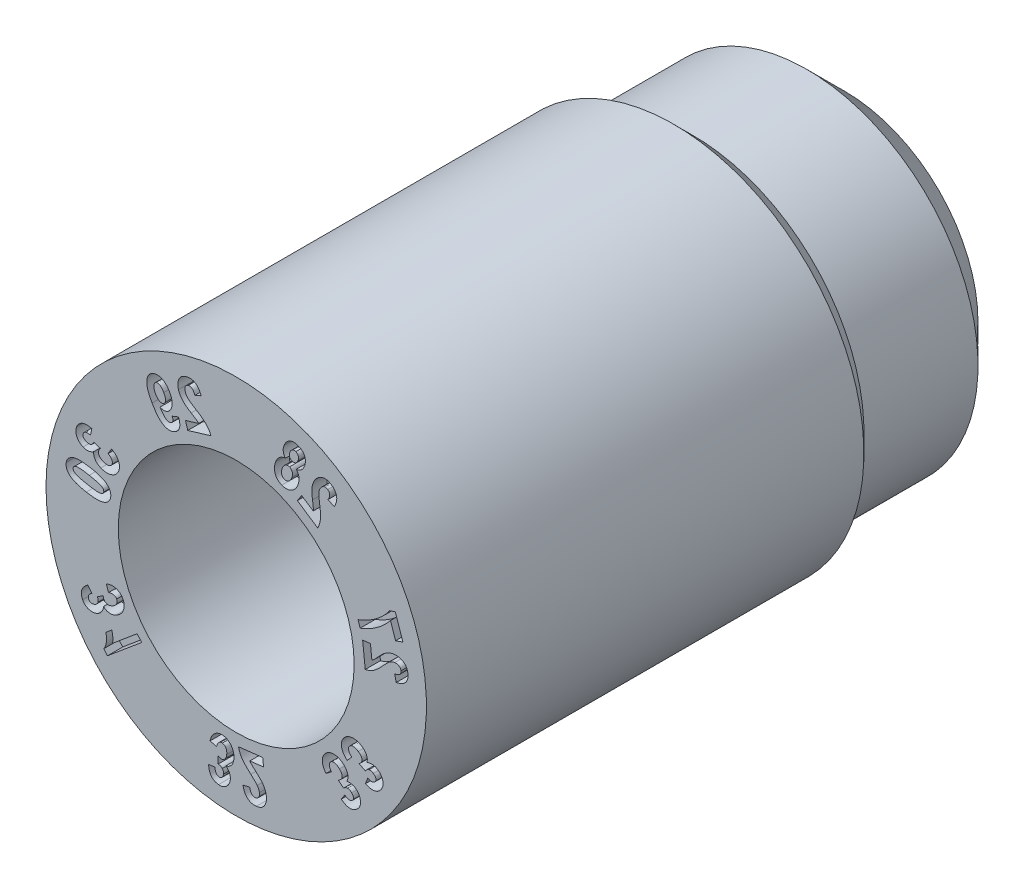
from build123d import *

# Parameters (mm, degrees)
CUT_EXTRUDE1_DEPTH = 0.2


with BuildPart() as part:
    # Sketch2 → Revolve1 (revolve)
    with BuildSketch(Plane(origin=(0, 0, 0), x_dir=(1, 0, 0), z_dir=(0, 1, 0)), mode=Mode.PRIVATE) as revolve1_sk:
        Polygon((1.749621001, 7.999984), (0.8, 7.999984), (0.8, 5.499984), (1.55, 5.499984), (1.55, 0), (2.5, 0), (2.5, 5.749984), (2.25, 5.999984), (2.25, 7.499605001), align=None)
    revolve(revolve1_sk.sketch.rotate(Axis((0, 0, -4.849143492), (0, 0, 1)), 180), axis=Axis((0, 0, -4.849143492), (0, 0, 1)))

    # Sketch8 → Cut-Extrude1 (cut)
    # profile 1 of 14: a face of its own
    with BuildSketch(Plane.XY):
        with BuildLine():
            Line((1.764054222, 0.345691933), (1.66131157, 0.334465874))
            Line((1.66131157, 0.334465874), (1.696060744, 0.016470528))
            add(Edge.make_bspline(
                [(1.696060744, 0.016470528), (1.705565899, 0.018599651), (1.724528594, 0.022847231), (1.75191618, 0.032733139), (1.778403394, 0.044806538), (1.799717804, 0.057207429), (1.816742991, 0.069014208), (1.830541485, 0.079405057), (1.845035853, 0.091610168), (1.860487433, 0.10536709), (1.876615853, 0.120978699), (1.893889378, 0.137941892), (1.911763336, 0.156828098), (1.923888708, 0.170026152), (1.930161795, 0.176854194)],
                knots=[0, 0, 0, 0, 1.210903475, 2.415741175, 3.614422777, 4.829304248, 5.477408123, 6.191639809, 6.977581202, 7.834306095, 8.765204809, 9.770030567, 10.846320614, 12, 12, 12, 12], degree=3))
            add(Edge.make_bspline(
                [(1.930161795, 0.176854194), (1.935076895, 0.182211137), (1.944457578, 0.192435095), (1.958037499, 0.206866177), (1.970314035, 0.219761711), (1.981594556, 0.230874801), (1.991350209, 0.240659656), (2.00000213, 0.248772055), (2.007423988, 0.255292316), (2.012159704, 0.258896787), (2.014268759, 0.26050204)],
                knots=[0, 0, 0, 0, 1.469359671, 2.804336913, 4.005076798, 5.067497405, 6.004650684, 6.797449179, 7.46444311, 8, 8, 8, 8], degree=3))
            add(Edge.make_bspline(
                [(2.014268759, 0.26050204), (2.019685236, 0.264278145), (2.03024477, 0.271639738), (2.047318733, 0.27996054), (2.064673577, 0.285899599), (2.076549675, 0.287760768), (2.082415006, 0.288679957)],
                knots=[0, 0, 0, 0, 1.061115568, 2.068666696, 3.046158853, 4, 4, 4, 4], degree=3))
            add(Edge.make_bspline(
                [(2.082415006, 0.288679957), (2.08837069, 0.28918595), (2.099602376, 0.29014019), (2.115580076, 0.28853442), (2.129579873, 0.284783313), (2.141420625, 0.278430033), (2.151090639, 0.270139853), (2.158388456, 0.260019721), (2.163486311, 0.24837618), (2.164812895, 0.239900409), (2.16549479, 0.235543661)],
                knots=[0, 0, 0, 0, 1.284830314, 2.42303217, 3.43989917, 4.386563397, 5.292301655, 6.158766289, 7.053562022, 8, 8, 8, 8], degree=3))
            add(Edge.make_bspline(
                [(2.16549479, 0.235543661), (2.165765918, 0.230765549), (2.166287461, 0.221574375), (2.163425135, 0.208215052), (2.157229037, 0.196425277), (2.148130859, 0.186069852), (2.135918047, 0.177345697), (2.120716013, 0.170365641), (2.102693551, 0.164411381), (2.089490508, 0.16198299), (2.082460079, 0.160689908)],
                knots=[0, 0, 0, 0, 0.913722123, 1.757635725, 2.579276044, 3.438933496, 4.37433614, 5.431505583, 6.632314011, 8, 8, 8, 8], degree=3))
            Line((2.082460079, 0.160689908), (2.103382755, 0.071899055))
            add(Edge.make_bspline(
                [(2.103382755, 0.071899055), (2.110396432, 0.073440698), (2.124017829, 0.076434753), (2.143543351, 0.082155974), (2.161449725, 0.088906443), (2.177858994, 0.096301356), (2.192639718, 0.104641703), (2.205873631, 0.113787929), (2.217511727, 0.123874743), (2.227582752, 0.134805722), (2.236129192, 0.146537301), (2.243375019, 0.158925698), (2.249193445, 0.172045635), (2.253465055, 0.185909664), (2.256635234, 0.200390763), (2.25816842, 0.215618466), (2.258274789, 0.231554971), (2.25736813, 0.242347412), (2.256903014, 0.247883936)],
                knots=[0, 0, 0, 0, 1.316678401, 2.557146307, 3.727226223, 4.823655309, 5.854584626, 6.835260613, 7.768888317, 8.673026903, 9.554907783, 10.425565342, 11.300463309, 12.180346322, 13.081818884, 14.014614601, 14.981496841, 16, 16, 16, 16], degree=3))
            add(Edge.make_bspline(
                [(2.256903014, 0.247883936), (2.256085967, 0.253885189), (2.254501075, 0.265526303), (2.250493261, 0.282297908), (2.2449135, 0.297659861), (2.238090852, 0.311847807), (2.229683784, 0.324572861), (2.219996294, 0.336146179), (2.208746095, 0.346224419), (2.19631932, 0.354975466), (2.183114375, 0.362504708), (2.169437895, 0.368750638), (2.155457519, 0.373790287), (2.14120341, 0.377692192), (2.126612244, 0.380209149), (2.111726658, 0.381701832), (2.096521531, 0.381856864), (2.086330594, 0.38095031), (2.081194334, 0.380493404)],
                knots=[0, 0, 0, 0, 1.173652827, 2.276629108, 3.335023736, 4.336619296, 5.321091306, 6.283820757, 7.254537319, 8.239831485, 9.225125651, 10.197062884, 11.150738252, 12.103199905, 13.057936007, 14.017536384, 15.000832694, 16, 16, 16, 16], degree=3))
            add(Edge.make_bspline(
                [(2.081194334, 0.380493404), (2.075339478, 0.379738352), (2.063684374, 0.378235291), (2.046566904, 0.374363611), (2.02981455, 0.369465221), (2.013403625, 0.363465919), (1.997281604, 0.35609575), (1.981308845, 0.347487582), (1.965401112, 0.337546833), (1.952201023, 0.328224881), (1.941439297, 0.319824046), (1.932910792, 0.312422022), (1.923824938, 0.304203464), (1.914267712, 0.295044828), (1.904137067, 0.285146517), (1.893642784, 0.274174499), (1.882555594, 0.262401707), (1.875085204, 0.254145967), (1.871250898, 0.249908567)],
                knots=[0, 0, 0, 0, 1.116805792, 2.223195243, 3.31725657, 4.418851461, 5.527133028, 6.669491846, 7.850789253, 9.075422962, 9.72636706, 10.433968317, 11.212223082, 12.045064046, 12.93920453, 13.892729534, 14.918407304, 16, 16, 16, 16], degree=3))
            add(Edge.make_bspline(
                [(1.871250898, 0.249908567), (1.867699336, 0.245987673), (1.860932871, 0.238517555), (1.851241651, 0.227911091), (1.842363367, 0.218541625), (1.834732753, 0.20998835), (1.827678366, 0.202896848), (1.821848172, 0.196666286), (1.81677148, 0.19173584), (1.809215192, 0.184432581), (1.798675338, 0.175237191), (1.788556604, 0.168659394), (1.783696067, 0.165499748)],
                knots=[0, 0, 0, 0, 1.30077431, 2.478245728, 3.532467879, 4.474445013, 5.295791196, 5.991390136, 6.572169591, 7.035389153, 8.575948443, 10, 10, 10, 10], degree=3))
            Line((1.783696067, 0.165499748), (1.764054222, 0.345691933))
        make_face()
    # profile 2 of 14: a face of its own
    with BuildSketch(Plane.XY):
        with BuildLine():
            Line((2.093857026, 0.542323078), (2.191779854, 0.575393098))
            Line((2.191779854, 0.575393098), (2.092083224, 0.871158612))
            Line((2.092083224, 0.871158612), (2.015547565, 0.845366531))
            add(Edge.make_bspline(
                [(2.015547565, 0.845366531), (2.012768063, 0.84101558), (2.007008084, 0.83199908), (1.997255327, 0.818630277), (1.986470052, 0.804753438), (1.974528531, 0.790495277), (1.9614393, 0.775808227), (1.947270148, 0.760682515), (1.931791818, 0.745284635), (1.909844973, 0.723886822), (1.880394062, 0.697716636), (1.843039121, 0.667662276), (1.803355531, 0.639425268), (1.768830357, 0.617419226), (1.740657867, 0.60085061), (1.719746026, 0.589179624), (1.699118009, 0.578399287), (1.678885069, 0.568177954), (1.658837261, 0.559054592), (1.639200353, 0.550503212), (1.619825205, 0.543001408), (1.606941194, 0.538482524), (1.600607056, 0.536260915)],
                knots=[0, 0, 0, 0, 0.589391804, 1.22139965, 1.888530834, 2.595967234, 3.344460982, 4.134646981, 4.962011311, 5.837122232, 7.634299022, 9.458009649, 11.308963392, 13.192414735, 14.13085863, 15.040563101, 15.926487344, 16.788336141, 17.628408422, 18.441066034, 19.23358484, 20, 20, 20, 20], degree=3))
            Line((1.600607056, 0.536260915), (1.628688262, 0.453034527))
            add(Edge.make_bspline(
                [(1.628688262, 0.453034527), (1.63834432, 0.456635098), (1.6576663, 0.463839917), (1.686082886, 0.4761955), (1.714259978, 0.489308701), (1.742020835, 0.503538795), (1.769413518, 0.518834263), (1.796528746, 0.534975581), (1.823132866, 0.552415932), (1.849398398, 0.570590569), (1.87491712, 0.589688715), (1.899753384, 0.60923721), (1.92339358, 0.629563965), (1.946153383, 0.650331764), (1.968078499, 0.671531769), (1.988812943, 0.693504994), (2.008772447, 0.715867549), (2.021264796, 0.731324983), (2.027498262, 0.739037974)],
                knots=[0, 0, 0, 0, 0.995711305, 1.992439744, 2.993334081, 3.998741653, 5.006170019, 6.02477866, 7.047414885, 8.079612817, 9.110870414, 10.127077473, 11.133342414, 12.122892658, 13.104282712, 14.079701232, 15.041804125, 16, 16, 16, 16], degree=3))
            Line((2.027498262, 0.739037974), (2.093857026, 0.542323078))
        make_face()
    # profile 3 of 14: a face of its own
    with BuildSketch(Plane.XY):
        with BuildLine():
            Line((0.860086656, 1.578670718), (0.803034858, 1.492184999))
            Line((0.803034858, 1.492184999), (1.070748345, 1.315464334))
            add(Edge.make_bspline(
                [(1.070748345, 1.315464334), (1.075154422, 1.324179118), (1.08392137, 1.341519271), (1.093868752, 1.368919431), (1.101442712, 1.397066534), (1.105635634, 1.42143098), (1.107513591, 1.442136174), (1.108139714, 1.45942906), (1.10809657, 1.478459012), (1.107423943, 1.499187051), (1.105904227, 1.521679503), (1.103552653, 1.545849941), (1.100798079, 1.571788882), (1.098309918, 1.589584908), (1.097024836, 1.598776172)],
                knots=[0, 0, 0, 0, 1.211128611, 2.409830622, 3.60989667, 4.825519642, 5.47257064, 6.189170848, 6.972404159, 7.834162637, 8.762772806, 9.769885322, 10.848193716, 12, 12, 12, 12], degree=3))
            add(Edge.make_bspline(
                [(1.097024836, 1.598776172), (1.096011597, 1.605986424), (1.094077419, 1.61975013), (1.091768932, 1.6394479), (1.08967846, 1.65717515), (1.088067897, 1.672952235), (1.086816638, 1.686797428), (1.08628869, 1.698678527), (1.085936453, 1.708610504), (1.086123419, 1.714570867), (1.086207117, 1.717239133)],
                knots=[0, 0, 0, 0, 1.467476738, 2.801277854, 3.997186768, 5.065137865, 5.997828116, 6.798379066, 7.462072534, 8, 8, 8, 8], degree=3))
            add(Edge.make_bspline(
                [(1.086207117, 1.717239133), (1.086765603, 1.723848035), (1.087851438, 1.736697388), (1.092394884, 1.755159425), (1.098825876, 1.772363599), (1.105007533, 1.782711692), (1.108067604, 1.78783425)],
                knots=[0, 0, 0, 0, 1.063550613, 2.067807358, 3.04351753, 4, 4, 4, 4], degree=3))
            add(Edge.make_bspline(
                [(1.108067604, 1.78783425), (1.111525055, 1.7927182), (1.118038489, 1.801918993), (1.129396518, 1.813330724), (1.141279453, 1.821710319), (1.153759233, 1.826758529), (1.16630726, 1.828947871), (1.178758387, 1.828136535), (1.191023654, 1.824676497), (1.198390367, 1.820242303), (1.202184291, 1.817958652)],
                knots=[0, 0, 0, 0, 1.284661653, 2.420152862, 3.444033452, 4.38881635, 5.290962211, 6.158498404, 7.0516099, 8, 8, 8, 8], degree=3))
            add(Edge.make_bspline(
                [(1.202184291, 1.817958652), (1.206054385, 1.815105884), (1.21349899, 1.809618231), (1.22195278, 1.798813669), (1.227170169, 1.786538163), (1.229145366, 1.772869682), (1.228105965, 1.757896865), (1.223890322, 1.741634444), (1.216692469, 1.72404398), (1.210208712, 1.71229889), (1.206756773, 1.706045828)],
                knots=[0, 0, 0, 0, 0.915780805, 1.761617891, 2.586518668, 3.437724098, 4.376759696, 5.43713321, 6.635535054, 8, 8, 8, 8], degree=3))
            Line((1.206756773, 1.706045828), (1.288794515, 1.665137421))
            add(Edge.make_bspline(
                [(1.288794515, 1.665137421), (1.292101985, 1.671544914), (1.298528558, 1.683994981), (1.306467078, 1.702737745), (1.312921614, 1.720797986), (1.317604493, 1.738198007), (1.320767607, 1.754954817), (1.321940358, 1.77104653), (1.321797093, 1.786468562), (1.319723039, 1.801249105), (1.316141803, 1.81534473), (1.311152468, 1.828867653), (1.30480738, 1.841795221), (1.296772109, 1.853979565), (1.287631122, 1.8657348), (1.27682556, 1.876704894), (1.264604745, 1.88699556), (1.255698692, 1.893217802), (1.251152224, 1.896394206)],
                knots=[0, 0, 0, 0, 1.317778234, 2.560506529, 3.717875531, 4.821184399, 5.851570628, 6.829951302, 7.766208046, 8.66570364, 9.551223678, 10.420090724, 11.296502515, 12.177275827, 13.083692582, 14.014660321, 14.986500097, 16, 16, 16, 16], degree=3))
            add(Edge.make_bspline(
                [(1.251152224, 1.896394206), (1.246001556, 1.899605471), (1.23598723, 1.90584906), (1.220425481, 1.913327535), (1.205056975, 1.919093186), (1.189686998, 1.922744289), (1.174461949, 1.924447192), (1.159352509, 1.924434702), (1.144378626, 1.922260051), (1.129679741, 1.918223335), (1.115495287, 1.912718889), (1.101854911, 1.906353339), (1.089056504, 1.89876654), (1.076835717, 1.890351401), (1.065648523, 1.880547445), (1.054951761, 1.870056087), (1.045105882, 1.858395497), (1.039290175, 1.849953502), (1.036342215, 1.845674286)],
                knots=[0, 0, 0, 0, 1.172658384, 2.27997269, 3.331601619, 4.340347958, 5.325291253, 6.287337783, 7.253203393, 8.241062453, 9.227756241, 10.191714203, 11.147492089, 12.100980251, 13.055644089, 14.01897528, 14.995825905, 16, 16, 16, 16], degree=3))
            add(Edge.make_bspline(
                [(1.036342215, 1.845674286), (1.033193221, 1.84064444), (1.026951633, 1.830674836), (1.018728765, 1.815099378), (1.012010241, 1.798972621), (1.006075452, 1.782470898), (1.001492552, 1.76531674), (0.99792733, 1.747461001), (0.995385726, 1.728828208), (0.994126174, 1.712664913), (0.993892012, 1.698949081), (0.99398593, 1.68765237), (0.994464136, 1.675400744), (0.995366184, 1.662213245), (0.996667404, 1.648050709), (0.998432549, 1.632910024), (1.000410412, 1.616798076), (1.002001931, 1.605756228), (1.002819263, 1.600085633)],
                knots=[0, 0, 0, 0, 1.120124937, 2.220187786, 3.320175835, 4.415741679, 5.528496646, 6.668643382, 7.851182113, 9.076817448, 9.726554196, 10.44041372, 11.209321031, 12.040847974, 12.935578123, 13.893979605, 14.91844298, 16, 16, 16, 16], degree=3))
            add(Edge.make_bspline(
                [(1.002819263, 1.600085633), (1.003553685, 1.594855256), (1.004955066, 1.584874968), (1.006982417, 1.570617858), (1.00858743, 1.557762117), (1.010019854, 1.546340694), (1.011182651, 1.5363526), (1.012212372, 1.527836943), (1.012746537, 1.52072024), (1.013496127, 1.510201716), (1.013838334, 1.49621234), (1.012432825, 1.484244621), (1.011760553, 1.478520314)],
                knots=[0, 0, 0, 0, 1.295743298, 2.47245889, 3.532732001, 4.474019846, 5.29634087, 5.999722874, 6.577996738, 7.046742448, 8.587420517, 10, 10, 10, 10], degree=3))
            Line((1.011760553, 1.478520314), (0.860086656, 1.578670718))
        make_face()
    # profile 4 of 14: a face of its own
    with BuildSketch(Plane.XY):
        with BuildLine():
            add(Edge.make_bspline(
                [(0.789740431, 1.841978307), (0.795859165, 1.842876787), (0.807830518, 1.844634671), (0.824888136, 1.850102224), (0.840545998, 1.857838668), (0.854826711, 1.867830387), (0.867649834, 1.880158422), (0.878876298, 1.894745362), (0.888843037, 1.911401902), (0.893929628, 1.923652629), (0.896558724, 1.929984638)],
                knots=[0, 0, 0, 0, 1.012728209, 1.98141119, 2.922709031, 3.866772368, 4.827864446, 5.827452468, 6.87707972, 8, 8, 8, 8], degree=3))
            add(Edge.make_bspline(
                [(0.896558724, 1.929984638), (0.898449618, 1.935246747), (0.90215112, 1.94554754), (0.906164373, 1.961120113), (0.908751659, 1.976305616), (0.909862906, 1.991100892), (0.909394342, 2.005477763), (0.907758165, 2.019512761), (0.904370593, 2.033146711), (0.899724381, 2.046382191), (0.893664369, 2.058994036), (0.886229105, 2.070704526), (0.877729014, 2.08169414), (0.867706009, 2.091529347), (0.856567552, 2.100588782), (0.844289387, 2.108845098), (0.830599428, 2.115965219), (0.820906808, 2.119969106), (0.815929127, 2.122025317)],
                knots=[0, 0, 0, 0, 1.140030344, 2.231655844, 3.274993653, 4.278603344, 5.252093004, 6.205108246, 7.155061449, 8.111095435, 9.062126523, 10.001914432, 10.935961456, 11.889413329, 12.858849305, 13.861501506, 14.901766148, 16, 16, 16, 16], degree=3))
            add(Edge.make_bspline(
                [(0.815929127, 2.122025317), (0.810589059, 2.123964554), (0.800212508, 2.127732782), (0.784489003, 2.131434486), (0.769327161, 2.133768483), (0.754586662, 2.134258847), (0.740336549, 2.133087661), (0.726523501, 2.130409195), (0.713260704, 2.125932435), (0.700657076, 2.119761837), (0.688698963, 2.112427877), (0.677531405, 2.104023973), (0.667042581, 2.094825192), (0.657679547, 2.084430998), (0.64892596, 2.073263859), (0.641330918, 2.060918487), (0.634253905, 2.047791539), (0.630459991, 2.03844977), (0.628539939, 2.033722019)],
                knots=[0, 0, 0, 0, 1.165954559, 2.265624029, 3.311519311, 4.312271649, 5.286993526, 6.242644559, 7.195131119, 8.1527843, 9.119076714, 10.071972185, 11.02053109, 11.979437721, 12.941048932, 13.930612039, 14.952708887, 16, 16, 16, 16], degree=3))
            add(Edge.make_bspline(
                [(0.628539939, 2.033722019), (0.626282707, 2.027213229), (0.621913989, 2.014615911), (0.618067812, 1.995376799), (0.616958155, 1.976669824), (0.618290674, 1.958572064), (0.622005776, 1.9413675), (0.628026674, 1.925241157), (0.636039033, 1.910142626), (0.643195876, 1.901331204), (0.646778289, 1.89692058)],
                knots=[0, 0, 0, 0, 1.13745818, 2.201472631, 3.230139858, 4.225162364, 5.191318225, 6.127942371, 7.062927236, 8, 8, 8, 8], degree=3))
            add(Edge.make_bspline(
                [(0.646778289, 1.89692058), (0.639435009, 1.896004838), (0.625131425, 1.894221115), (0.604712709, 1.887957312), (0.586060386, 1.878809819), (0.569073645, 1.866851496), (0.553742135, 1.852135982), (0.540290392, 1.834438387), (0.528221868, 1.814081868), (0.522014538, 1.799020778), (0.518801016, 1.791223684)],
                knots=[0, 0, 0, 0, 1.007497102, 1.962449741, 2.896132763, 3.829080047, 4.783733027, 5.781456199, 6.851464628, 8, 8, 8, 8], degree=3))
            add(Edge.make_bspline(
                [(0.518801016, 1.791223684), (0.515893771, 1.782966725), (0.510212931, 1.766832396), (0.504822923, 1.742283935), (0.502318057, 1.718301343), (0.502767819, 1.695090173), (0.505943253, 1.672920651), (0.511911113, 1.652166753), (0.520714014, 1.63303717), (0.53194196, 1.615554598), (0.545662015, 1.60006593), (0.561470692, 1.586670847), (0.579248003, 1.575322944), (0.592310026, 1.569797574), (0.598947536, 1.566989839)],
                knots=[0, 0, 0, 0, 1.178163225, 2.302164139, 3.375934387, 4.418905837, 5.42086287, 6.384235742, 7.316726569, 8.247299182, 9.172757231, 10.092541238, 11.030718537, 12, 12, 12, 12], degree=3))
            add(Edge.make_bspline(
                [(0.598947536, 1.566989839), (0.604257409, 1.565073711), (0.614675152, 1.561314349), (0.630674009, 1.557671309), (0.646495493, 1.555658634), (0.662185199, 1.555157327), (0.677684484, 1.556496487), (0.692997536, 1.559498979), (0.708163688, 1.564125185), (0.722975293, 1.570529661), (0.737391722, 1.578265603), (0.750754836, 1.587853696), (0.763467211, 1.598551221), (0.774836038, 1.611092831), (0.785570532, 1.624819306), (0.795128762, 1.640191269), (0.803914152, 1.65692807), (0.808806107, 1.668836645), (0.811310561, 1.674933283)],
                knots=[0, 0, 0, 0, 1.011262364, 1.984053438, 2.9342064, 3.867205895, 4.79272605, 5.716909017, 6.660164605, 7.629364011, 8.605885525, 9.586955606, 10.572754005, 11.5786211, 12.615413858, 13.6930779, 14.81896289, 16, 16, 16, 16], degree=3))
            add(Edge.make_bspline(
                [(0.811310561, 1.674933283), (0.814109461, 1.682930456), (0.819542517, 1.698454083), (0.824296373, 1.722012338), (0.826158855, 1.744751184), (0.824899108, 1.766634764), (0.820536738, 1.787491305), (0.813303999, 1.80715363), (0.803124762, 1.825587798), (0.794239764, 1.836468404), (0.789740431, 1.841978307)],
                knots=[0, 0, 0, 0, 1.143674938, 2.220032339, 3.236775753, 4.218812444, 5.170879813, 6.105057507, 7.040407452, 8, 8, 8, 8], degree=3))
        make_face()
        with BuildLine():
            add(Edge.make_bspline(
                [(0.812645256, 1.953763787), (0.81055044, 1.948793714), (0.806586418, 1.939388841), (0.798617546, 1.927076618), (0.789485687, 1.917256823), (0.779109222, 1.910203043), (0.768127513, 1.90573165), (0.7567916, 1.903847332), (0.745246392, 1.904455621), (0.737882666, 1.906847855), (0.734115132, 1.908071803)],
                knots=[0, 0, 0, 0, 1.26468997, 2.393173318, 3.425445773, 4.393029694, 5.316027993, 6.187998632, 7.072918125, 8, 8, 8, 8], degree=3))
            add(Edge.make_bspline(
                [(0.734115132, 1.908071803), (0.730401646, 1.909692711), (0.72318034, 1.912844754), (0.714038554, 1.92023347), (0.706715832, 1.929217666), (0.70146876, 1.939929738), (0.698499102, 1.952130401), (0.698135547, 1.965570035), (0.700510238, 1.980089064), (0.703880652, 1.989741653), (0.705659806, 1.994837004)],
                knots=[0, 0, 0, 0, 0.941551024, 1.830955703, 2.711131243, 3.627117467, 4.589127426, 5.61822806, 6.742724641, 8, 8, 8, 8], degree=3))
            add(Edge.make_bspline(
                [(0.705659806, 1.994837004), (0.707676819, 1.999665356), (0.711502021, 2.008822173), (0.71933715, 2.020794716), (0.728409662, 2.03036528), (0.738803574, 2.037192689), (0.749718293, 2.041652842), (0.760975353, 2.043641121), (0.772429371, 2.043142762), (0.779700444, 2.040723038), (0.783410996, 2.039488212)],
                knots=[0, 0, 0, 0, 1.244929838, 2.360969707, 3.390128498, 4.365246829, 5.301909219, 6.180990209, 7.071728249, 8, 8, 8, 8], degree=3))
            add(Edge.make_bspline(
                [(0.783410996, 2.039488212), (0.787153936, 2.037840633), (0.794435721, 2.034635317), (0.803631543, 2.02719584), (0.811032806, 2.01815348), (0.816213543, 2.007344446), (0.819148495, 1.99521643), (0.819749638, 1.982021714), (0.817511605, 1.96795642), (0.814315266, 1.958634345), (0.812645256, 1.953763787)],
                knots=[0, 0, 0, 0, 0.96016881, 1.867981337, 2.757240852, 3.694704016, 4.666642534, 5.680048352, 6.78788156, 8, 8, 8, 8], degree=3))
        make_face(mode=Mode.SUBTRACT)
        with BuildLine():
            add(Edge.make_bspline(
                [(0.730920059, 1.717397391), (0.729467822, 1.713862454), (0.726647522, 1.706997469), (0.722048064, 1.697225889), (0.716971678, 1.688389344), (0.711508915, 1.68043817), (0.705872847, 1.673122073), (0.699640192, 1.666866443), (0.693301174, 1.661228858), (0.684402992, 1.655421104), (0.673190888, 1.649823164), (0.659344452, 1.64637822), (0.645538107, 1.646282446), (0.636944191, 1.648918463), (0.632594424, 1.650252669)],
                knots=[0, 0, 0, 0, 1.037080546, 2.014050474, 2.928697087, 3.799015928, 4.631182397, 5.43034209, 6.192324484, 6.928274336, 8.308317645, 9.57225886, 10.771211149, 12, 12, 12, 12], degree=3))
            add(Edge.make_bspline(
                [(0.632594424, 1.650252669), (0.62847203, 1.65211698), (0.620360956, 1.655785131), (0.610341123, 1.664880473), (0.602505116, 1.67623723), (0.598008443, 1.687443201), (0.595635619, 1.697376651), (0.594647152, 1.705512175), (0.594445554, 1.714157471), (0.595196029, 1.723271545), (0.596611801, 1.732911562), (0.598980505, 1.743007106), (0.602045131, 1.753649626), (0.604683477, 1.760787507), (0.606037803, 1.764451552)],
                knots=[0, 0, 0, 0, 1.235150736, 2.430238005, 3.657622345, 4.996262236, 5.71598327, 6.456344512, 7.240794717, 8.084957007, 8.962841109, 9.912336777, 10.928352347, 12, 12, 12, 12], degree=3))
            add(Edge.make_bspline(
                [(0.606037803, 1.764451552), (0.608586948, 1.770580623), (0.613443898, 1.782258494), (0.623399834, 1.797506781), (0.634601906, 1.810057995), (0.64733317, 1.819405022), (0.660725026, 1.825742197), (0.674322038, 1.82908081), (0.688037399, 1.828956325), (0.696617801, 1.826221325), (0.700966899, 1.824835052)],
                knots=[0, 0, 0, 0, 1.267815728, 2.415600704, 3.466606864, 4.470693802, 5.416009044, 6.284390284, 7.130419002, 8, 8, 8, 8], degree=3))
            add(Edge.make_bspline(
                [(0.700966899, 1.824835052), (0.705086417, 1.822968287), (0.713227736, 1.819279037), (0.723345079, 1.810144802), (0.73112592, 1.798556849), (0.736753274, 1.784894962), (0.739937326, 1.76947232), (0.739845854, 1.752802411), (0.737133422, 1.735124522), (0.733049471, 1.723472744), (0.730920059, 1.717397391)],
                knots=[0, 0, 0, 0, 0.870249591, 1.719856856, 2.59376831, 3.550621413, 4.559518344, 5.617277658, 6.757624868, 8, 8, 8, 8], degree=3))
        make_face(mode=Mode.SUBTRACT)
    # profile 5 of 14: a face of its own
    with BuildSketch(Plane.XY):
        with BuildLine():
            Line((-0.666698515, 1.669654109), (-0.636692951, 1.570788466))
            Line((-0.636692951, 1.570788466), (-0.33053568, 1.66365837))
            add(Edge.make_bspline(
                [(-0.33053568, 1.66365837), (-0.334390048, 1.672611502), (-0.342072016, 1.690455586), (-0.356855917, 1.715554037), (-0.373537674, 1.739414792), (-0.389622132, 1.758115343), (-0.404297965, 1.77273845), (-0.417161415, 1.78424725), (-0.431786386, 1.796345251), (-0.448265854, 1.808839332), (-0.466445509, 1.821988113), (-0.486392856, 1.835718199), (-0.508191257, 1.849899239), (-0.523405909, 1.859401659), (-0.531240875, 1.864295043)],
                knots=[0, 0, 0, 0, 1.211662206, 2.414909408, 3.615976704, 4.830427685, 5.477515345, 6.192534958, 6.977015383, 7.838303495, 8.764910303, 9.768260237, 10.850739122, 12, 12, 12, 12], degree=3))
            add(Edge.make_bspline(
                [(-0.531240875, 1.864295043), (-0.537416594, 1.868130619), (-0.549189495, 1.875442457), (-0.565811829, 1.88616892), (-0.58073739, 1.895886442), (-0.593817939, 1.90477871), (-0.60527155, 1.912575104), (-0.61476024, 1.919682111), (-0.622625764, 1.925697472), (-0.627018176, 1.929693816), (-0.628968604, 1.931468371)],
                knots=[0, 0, 0, 0, 1.469729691, 2.801776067, 3.99946149, 5.070245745, 5.999621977, 6.799919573, 7.467110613, 8, 8, 8, 8], degree=3))
            add(Edge.make_bspline(
                [(-0.628968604, 1.931468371), (-0.63370909, 1.936102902), (-0.642923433, 1.945111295), (-0.654108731, 1.960446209), (-0.663347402, 1.976298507), (-0.667263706, 1.987688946), (-0.669205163, 1.993335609)],
                knots=[0, 0, 0, 0, 1.063928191, 2.06801564, 3.042243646, 4, 4, 4, 4], degree=3))
            add(Edge.make_bspline(
                [(-0.669205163, 1.993335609), (-0.670732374, 1.999088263), (-0.673621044, 2.009969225), (-0.675300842, 2.025958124), (-0.674102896, 2.04042649), (-0.670172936, 2.053220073), (-0.663717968, 2.064154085), (-0.655310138, 2.07330525), (-0.644673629, 2.080404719), (-0.636581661, 2.083289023), (-0.632380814, 2.084786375)],
                knots=[0, 0, 0, 0, 1.280473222, 2.421974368, 3.443187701, 4.386547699, 5.278257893, 6.155280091, 7.042335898, 8, 8, 8, 8], degree=3))
            add(Edge.make_bspline(
                [(-0.632380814, 2.084786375), (-0.62773541, 2.085905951), (-0.618781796, 2.088063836), (-0.60509049, 2.087796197), (-0.592314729, 2.083870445), (-0.580523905, 2.076727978), (-0.569670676, 2.06638298), (-0.56001811, 2.052714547), (-0.550868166, 2.036093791), (-0.546079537, 2.023576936), (-0.543530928, 2.016915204)],
                knots=[0, 0, 0, 0, 0.912538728, 1.758839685, 2.586118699, 3.443057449, 4.376147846, 5.436434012, 6.635616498, 8, 8, 8, 8], degree=3))
            Line((-0.543530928, 2.016915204), (-0.460016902, 2.053787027))
            add(Edge.make_bspline(
                [(-0.460016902, 2.053787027), (-0.462839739, 2.060424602), (-0.468306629, 2.073279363), (-0.477585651, 2.091386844), (-0.487358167, 2.107794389), (-0.497719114, 2.122503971), (-0.508643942, 2.135537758), (-0.520175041, 2.146824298), (-0.532113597, 2.156585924), (-0.544821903, 2.164351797), (-0.557924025, 2.170593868), (-0.571451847, 2.175467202), (-0.585433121, 2.178742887), (-0.599873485, 2.180455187), (-0.614715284, 2.180784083), (-0.630008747, 2.179475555), (-0.645727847, 2.176793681), (-0.65617151, 2.173855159), (-0.66148932, 2.172358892)],
                knots=[0, 0, 0, 0, 1.321043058, 2.558418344, 3.724150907, 4.816971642, 5.851143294, 6.835018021, 7.769260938, 8.669804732, 9.556038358, 10.424253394, 11.29889985, 12.180575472, 13.083782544, 14.013619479, 14.98855462, 16, 16, 16, 16], degree=3))
            add(Edge.make_bspline(
                [(-0.66148932, 2.172358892), (-0.667244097, 2.170500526), (-0.678447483, 2.166882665), (-0.6940673, 2.159619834), (-0.708206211, 2.151397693), (-0.720781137, 2.141998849), (-0.731885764, 2.131529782), (-0.741289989, 2.119742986), (-0.749241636, 2.106916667), (-0.755475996, 2.09304386), (-0.760262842, 2.078638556), (-0.764094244, 2.064083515), (-0.766457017, 2.049420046), (-0.767618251, 2.034656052), (-0.767402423, 2.01983482), (-0.765981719, 2.004920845), (-0.763417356, 1.989916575), (-0.760622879, 1.98005371), (-0.759208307, 1.975061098)],
                knots=[0, 0, 0, 0, 1.170981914, 2.27966451, 3.330614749, 4.33559673, 5.315534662, 6.279774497, 7.24939451, 8.232600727, 9.219503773, 10.188676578, 11.146148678, 12.093698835, 13.055297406, 14.014609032, 14.994989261, 16, 16, 16, 16], degree=3))
            add(Edge.make_bspline(
                [(-0.759208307, 1.975061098), (-0.757407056, 1.969449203), (-0.753822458, 1.958281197), (-0.746896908, 1.942193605), (-0.739128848, 1.926592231), (-0.730048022, 1.911647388), (-0.719923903, 1.897082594), (-0.708473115, 1.882976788), (-0.695687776, 1.869278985), (-0.684089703, 1.858018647), (-0.673795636, 1.8490433), (-0.665011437, 1.841958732), (-0.655379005, 1.834431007), (-0.644641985, 1.82670594), (-0.632892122, 1.81877024), (-0.620325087, 1.810258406), (-0.606686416, 1.801543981), (-0.597181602, 1.795745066), (-0.592281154, 1.792755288)],
                knots=[0, 0, 0, 0, 1.115178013, 2.219270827, 3.31181266, 4.412227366, 5.526489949, 6.667557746, 7.848276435, 9.071940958, 9.725932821, 10.433053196, 11.208091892, 12.039974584, 12.936420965, 13.892218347, 14.913279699, 16, 16, 16, 16], degree=3))
            add(Edge.make_bspline(
                [(-0.592281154, 1.792755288), (-0.587788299, 1.79000759), (-0.579220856, 1.784767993), (-0.567078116, 1.777130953), (-0.556117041, 1.770346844), (-0.546489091, 1.764144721), (-0.538051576, 1.758779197), (-0.530916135, 1.754071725), (-0.525100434, 1.750004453), (-0.516511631, 1.743937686), (-0.505755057, 1.735032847), (-0.497297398, 1.726461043), (-0.493243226, 1.722352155)],
                knots=[0, 0, 0, 0, 1.296189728, 2.471709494, 3.530557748, 4.468817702, 5.290417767, 5.991582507, 6.572541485, 7.037027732, 8.579701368, 10, 10, 10, 10], degree=3))
            Line((-0.493243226, 1.722352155), (-0.666698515, 1.669654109))
        make_face()
    # profile 6 of 14: a face of its own
    with BuildSketch(Plane.XY):
        with BuildLine():
            Line((-0.759354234, 1.663900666), (-0.842302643, 1.630995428))
            add(Edge.make_bspline(
                [(-0.842302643, 1.630995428), (-0.840371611, 1.626252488), (-0.836733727, 1.617317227), (-0.83322137, 1.60410701), (-0.831574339, 1.59201585), (-0.832226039, 1.581035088), (-0.834852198, 1.571090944), (-0.839761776, 1.562402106), (-0.846718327, 1.55484942), (-0.852580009, 1.551181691), (-0.855613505, 1.549283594)],
                knots=[0, 0, 0, 0, 1.332555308, 2.510410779, 3.55084419, 4.496890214, 5.357227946, 6.205836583, 7.071497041, 8, 8, 8, 8], degree=3))
            add(Edge.make_bspline(
                [(-0.855613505, 1.549283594), (-0.857836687, 1.54814767), (-0.862216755, 1.545909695), (-0.869282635, 1.543827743), (-0.876491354, 1.542631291), (-0.883922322, 1.542574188), (-0.891510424, 1.543597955), (-0.899268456, 1.545691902), (-0.907152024, 1.548928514), (-0.915489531, 1.55302792), (-0.924113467, 1.558986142), (-0.9333771, 1.566682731), (-0.943031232, 1.576599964), (-0.953467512, 1.588332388), (-0.964491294, 1.602137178), (-0.976197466, 1.617940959), (-0.988514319, 1.635807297), (-0.996723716, 1.648519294), (-1.001017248, 1.655167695)],
                knots=[0, 0, 0, 0, 0.607380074, 1.19664812, 1.78684659, 2.38390045, 3.000470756, 3.648074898, 4.336674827, 5.075255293, 5.908112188, 6.884565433, 8.007145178, 9.277616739, 10.711487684, 12.311506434, 14.070910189, 16, 16, 16, 16], degree=3))
            add(Edge.make_bspline(
                [(-1.001017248, 1.655167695), (-0.996625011, 1.653231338), (-0.988096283, 1.649471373), (-0.975101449, 1.645191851), (-0.962257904, 1.642904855), (-0.94969642, 1.641805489), (-0.937337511, 1.642451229), (-0.925309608, 1.64497663), (-0.913390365, 1.648776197), (-0.905936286, 1.652696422), (-0.902134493, 1.654695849)],
                knots=[0, 0, 0, 0, 1.117157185, 2.16926554, 3.175053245, 4.147065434, 5.099489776, 6.043072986, 7.00191162, 8, 8, 8, 8], degree=3))
            add(Edge.make_bspline(
                [(-0.902134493, 1.654695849), (-0.898306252, 1.656991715), (-0.890673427, 1.66156926), (-0.880563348, 1.670283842), (-0.871390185, 1.679979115), (-0.863475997, 1.691005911), (-0.856783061, 1.703284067), (-0.851097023, 1.716727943), (-0.846644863, 1.731443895), (-0.843380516, 1.747200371), (-0.841354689, 1.7637262), (-0.841196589, 1.780723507), (-0.842513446, 1.798026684), (-0.845796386, 1.815530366), (-0.850432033, 1.833364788), (-0.856913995, 1.851415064), (-0.864840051, 1.86986909), (-0.871390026, 1.881882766), (-0.87474446, 1.888035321)],
                knots=[0, 0, 0, 0, 0.821318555, 1.63756138, 2.450081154, 3.276886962, 4.130814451, 5.022446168, 5.962370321, 6.959402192, 7.985018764, 9.025386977, 10.086944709, 11.177936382, 12.302875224, 13.47953104, 14.70919414, 16, 16, 16, 16], degree=3))
            add(Edge.make_bspline(
                [(-0.87474446, 1.888035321), (-0.878531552, 1.894483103), (-0.885904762, 1.907036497), (-0.89811292, 1.924519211), (-0.910803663, 1.940370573), (-0.924321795, 1.954283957), (-0.938144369, 1.966792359), (-0.952917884, 1.977139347), (-0.96805741, 1.986098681), (-0.983846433, 1.992960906), (-0.999681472, 1.998271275), (-1.015466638, 2.001780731), (-1.030997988, 2.003501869), (-1.046306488, 2.003507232), (-1.061381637, 2.001764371), (-1.076165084, 1.998061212), (-1.090800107, 1.992898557), (-1.100027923, 1.988022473), (-1.104710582, 1.985548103)],
                knots=[0, 0, 0, 0, 1.283387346, 2.498668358, 3.657656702, 4.765346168, 5.82625768, 6.852742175, 7.85654592, 8.841552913, 9.802287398, 10.720328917, 11.612277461, 12.479807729, 13.343485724, 14.210309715, 15.091820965, 16, 16, 16, 16], degree=3))
            add(Edge.make_bspline(
                [(-1.104710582, 1.985548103), (-1.109772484, 1.982507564), (-1.119734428, 1.97652371), (-1.132843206, 1.96521205), (-1.144414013, 1.952702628), (-1.154223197, 1.938640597), (-1.162122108, 1.922986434), (-1.168286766, 1.905915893), (-1.172854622, 1.887427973), (-1.175512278, 1.867469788), (-1.176218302, 1.845851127), (-1.173847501, 1.822569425), (-1.169059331, 1.797604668), (-1.161753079, 1.770913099), (-1.151526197, 1.742604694), (-1.138718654, 1.712581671), (-1.123432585, 1.680765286), (-1.111714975, 1.659354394), (-1.105634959, 1.648244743)],
                knots=[0, 0, 0, 0, 0.751490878, 1.478952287, 2.19785452, 2.919395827, 3.656590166, 4.426492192, 5.228407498, 6.079450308, 6.988797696, 7.978997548, 9.055491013, 10.226406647, 11.502627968, 12.889153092, 14.385848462, 16, 16, 16, 16], degree=3))
            add(Edge.make_bspline(
                [(-1.105634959, 1.648244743), (-1.099196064, 1.637105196), (-1.086759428, 1.615589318), (-1.067302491, 1.585338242), (-1.047678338, 1.558443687), (-1.028425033, 1.534469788), (-1.008948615, 1.513904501), (-0.989502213, 1.496486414), (-0.970237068, 1.482031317), (-0.950731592, 1.471085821), (-0.931518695, 1.462841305), (-0.912628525, 1.457012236), (-0.894037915, 1.453377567), (-0.875682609, 1.452405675), (-0.857525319, 1.453534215), (-0.839692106, 1.4572928), (-0.822071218, 1.463194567), (-0.811016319, 1.468984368), (-0.805397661, 1.471927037)],
                knots=[0, 0, 0, 0, 1.584132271, 3.059729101, 4.426024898, 5.681905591, 6.843172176, 7.909055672, 8.893499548, 9.802100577, 10.656024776, 11.463242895, 12.232146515, 12.982014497, 13.72045307, 14.46557619, 15.220128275, 16, 16, 16, 16], degree=3))
            add(Edge.make_bspline(
                [(-0.805397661, 1.471927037), (-0.801602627, 1.47416758), (-0.794166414, 1.478557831), (-0.78397641, 1.4862855), (-0.774781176, 1.494553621), (-0.766633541, 1.503538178), (-0.759655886, 1.513289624), (-0.753587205, 1.523633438), (-0.748683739, 1.534733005), (-0.744875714, 1.546485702), (-0.742121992, 1.558884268), (-0.74075959, 1.571980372), (-0.740706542, 1.585715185), (-0.741997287, 1.60011486), (-0.74420756, 1.615194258), (-0.748075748, 1.630889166), (-0.753073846, 1.647259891), (-0.757224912, 1.658258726), (-0.759354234, 1.663900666)],
                knots=[0, 0, 0, 0, 0.965795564, 1.892436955, 2.798928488, 3.674685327, 4.546375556, 5.424116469, 6.300253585, 7.20179124, 8.12959021, 9.080244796, 10.083594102, 11.136794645, 12.248298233, 13.422467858, 14.677834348, 16, 16, 16, 16], degree=3))
        make_face()
        with BuildLine():
            add(Edge.make_bspline(
                [(-1.059243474, 1.774857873), (-1.061348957, 1.778760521), (-1.065443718, 1.786350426), (-1.070822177, 1.797719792), (-1.075185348, 1.808760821), (-1.078451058, 1.81947645), (-1.080936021, 1.829752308), (-1.082409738, 1.839683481), (-1.082983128, 1.849222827), (-1.082524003, 1.858318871), (-1.081320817, 1.866832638), (-1.079635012, 1.87476057), (-1.07713678, 1.881940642), (-1.074281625, 1.888513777), (-1.070440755, 1.894139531), (-1.066340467, 1.899263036), (-1.061464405, 1.903613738), (-1.057776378, 1.905856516), (-1.055914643, 1.906988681)],
                knots=[0, 0, 0, 0, 1.461390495, 2.842125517, 4.142988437, 5.370377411, 6.531617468, 7.624313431, 8.675200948, 9.676219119, 10.62024397, 11.507571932, 12.342073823, 13.123174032, 13.860673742, 14.579342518, 15.282845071, 16, 16, 16, 16], degree=3))
            add(Edge.make_bspline(
                [(-1.055914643, 1.906988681), (-1.052196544, 1.908767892), (-1.04485204, 1.912282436), (-1.032412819, 1.91358908), (-1.019612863, 1.911815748), (-1.00891691, 1.907667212), (-1.000202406, 1.902831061), (-0.993642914, 1.897703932), (-0.986846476, 1.891704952), (-0.980225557, 1.884367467), (-0.973318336, 1.876108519), (-0.966664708, 1.866554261), (-0.959712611, 1.856033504), (-0.955386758, 1.848456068), (-0.953132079, 1.844506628)],
                knots=[0, 0, 0, 0, 1.099347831, 2.171583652, 3.298473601, 4.541708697, 5.226472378, 5.967237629, 6.770616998, 7.657252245, 8.616335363, 9.658842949, 10.779764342, 12, 12, 12, 12], degree=3))
            add(Edge.make_bspline(
                [(-0.953132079, 1.844506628), (-0.950942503, 1.840511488), (-0.946723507, 1.832813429), (-0.941243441, 1.821313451), (-0.936748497, 1.8103698), (-0.93325798, 1.7999451), (-0.930626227, 1.79007915), (-0.928992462, 1.780722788), (-0.928376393, 1.771888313), (-0.928771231, 1.761199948), (-0.93110002, 1.74900869), (-0.936654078, 1.736241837), (-0.944758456, 1.725551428), (-0.952025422, 1.720792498), (-0.955699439, 1.71838649)],
                knots=[0, 0, 0, 0, 1.168049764, 2.250662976, 3.264734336, 4.199886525, 5.067854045, 5.88079103, 6.631597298, 7.334146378, 8.619945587, 9.786651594, 10.88098013, 12, 12, 12, 12], degree=3))
            add(Edge.make_bspline(
                [(-0.955699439, 1.71838649), (-0.959472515, 1.716603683), (-0.967027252, 1.713034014), (-0.979863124, 1.71157287), (-0.993196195, 1.713522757), (-1.004476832, 1.717448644), (-1.013570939, 1.72227109), (-1.020509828, 1.726940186), (-1.027383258, 1.732486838), (-1.034053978, 1.739086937), (-1.040556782, 1.746666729), (-1.047026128, 1.755137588), (-1.053246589, 1.764641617), (-1.057200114, 1.771376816), (-1.059243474, 1.774857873)],
                knots=[0, 0, 0, 0, 1.140306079, 2.283206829, 3.484770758, 4.818647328, 5.542043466, 6.307947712, 7.112751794, 7.965013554, 8.881884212, 9.854573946, 10.891146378, 12, 12, 12, 12], degree=3))
        make_face(mode=Mode.SUBTRACT)
    # profile 7 of 14: a face of its own
    with BuildSketch(Plane.XY):
        with BuildLine():
            Line((-1.638085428, 0.859593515), (-1.684586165, 0.782631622))
            add(Edge.make_bspline(
                [(-1.684586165, 0.782631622), (-1.678874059, 0.779383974), (-1.668030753, 0.773218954), (-1.65385007, 0.762336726), (-1.64269898, 0.750449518), (-1.634645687, 0.737718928), (-1.629548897, 0.724695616), (-1.627300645, 0.71176652), (-1.627854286, 0.698996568), (-1.630647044, 0.691083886), (-1.632056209, 0.687091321)],
                knots=[0, 0, 0, 0, 1.311664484, 2.489936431, 3.556307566, 4.550938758, 5.481269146, 6.33138414, 7.15805327, 8, 8, 8, 8], degree=3))
            add(Edge.make_bspline(
                [(-1.632056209, 0.687091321), (-1.63410782, 0.682980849), (-1.638168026, 0.67484609), (-1.647977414, 0.66495424), (-1.660216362, 0.657469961), (-1.672119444, 0.65337508), (-1.682570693, 0.651301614), (-1.690997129, 0.650453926), (-1.69974295, 0.650506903), (-1.708823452, 0.651219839), (-1.718220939, 0.652978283), (-1.727982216, 0.655392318), (-1.738126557, 0.658559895), (-1.744840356, 0.6613048), (-1.748303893, 0.66272085)],
                knots=[0, 0, 0, 0, 1.244478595, 2.462864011, 3.732944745, 5.123862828, 5.864681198, 6.632213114, 7.425487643, 8.24362551, 9.109284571, 10.025486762, 10.981381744, 12, 12, 12, 12], degree=3))
            add(Edge.make_bspline(
                [(-1.748303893, 0.66272085), (-1.754446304, 0.6655158), (-1.766137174, 0.670835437), (-1.781399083, 0.68117547), (-1.793962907, 0.692575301), (-1.802997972, 0.705443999), (-1.809219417, 0.718642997), (-1.812098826, 0.731885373), (-1.812053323, 0.745040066), (-1.809196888, 0.753143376), (-1.807751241, 0.757244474)],
                knots=[0, 0, 0, 0, 1.302236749, 2.478551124, 3.548695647, 4.562214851, 5.497701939, 6.349714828, 7.164788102, 8, 8, 8, 8], degree=3))
            add(Edge.make_bspline(
                [(-1.807751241, 0.757244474), (-1.806454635, 0.760039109), (-1.803746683, 0.765875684), (-1.798177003, 0.774454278), (-1.791641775, 0.7835921), (-1.786471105, 0.789543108), (-1.783780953, 0.792639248)],
                knots=[0, 0, 0, 0, 0.860435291, 1.797013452, 2.85384906, 4, 4, 4, 4], degree=3))
            Line((-1.783780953, 0.792639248), (-1.871920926, 0.818771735))
            add(Edge.make_bspline(
                [(-1.871920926, 0.818771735), (-1.874215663, 0.813629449), (-1.878609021, 0.803784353), (-1.887626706, 0.790934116), (-1.898567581, 0.780849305), (-1.907077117, 0.776402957), (-1.911291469, 0.7742009)],
                knots=[0, 0, 0, 0, 1.105977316, 2.117434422, 3.067658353, 4, 4, 4, 4], degree=3))
            add(Edge.make_bspline(
                [(-1.911291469, 0.7742009), (-1.91580816, 0.772701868), (-1.924934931, 0.769672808), (-1.939856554, 0.768977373), (-1.955510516, 0.77146797), (-1.965737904, 0.775323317), (-1.971101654, 0.777345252)],
                knots=[0, 0, 0, 0, 0.92563035, 1.870399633, 2.883131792, 4, 4, 4, 4], degree=3))
            add(Edge.make_bspline(
                [(-1.971101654, 0.777345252), (-1.975457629, 0.779328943), (-1.98374307, 0.783102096), (-1.994490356, 0.790684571), (-2.003260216, 0.799168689), (-2.009405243, 0.808937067), (-2.013412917, 0.819152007), (-2.014958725, 0.829724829), (-2.014027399, 0.840472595), (-2.011602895, 0.847287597), (-2.010357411, 0.85078851)],
                knots=[0, 0, 0, 0, 1.224958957, 2.329978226, 3.356209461, 4.332917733, 5.265574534, 6.150965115, 7.050138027, 8, 8, 8, 8], degree=3))
            add(Edge.make_bspline(
                [(-2.010357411, 0.85078851), (-2.008681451, 0.854176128), (-2.005360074, 0.860889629), (-1.997517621, 0.869195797), (-1.987922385, 0.87588362), (-1.976408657, 0.880798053), (-1.96308942, 0.883467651), (-1.94822075, 0.883515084), (-1.93192114, 0.881097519), (-1.920849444, 0.877832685), (-1.914990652, 0.876105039)],
                knots=[0, 0, 0, 0, 0.82908209, 1.6430556, 2.484624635, 3.393513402, 4.381703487, 5.458115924, 6.654915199, 8, 8, 8, 8], degree=3))
            Line((-1.914990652, 0.876105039), (-1.89820697, 0.961337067))
            add(Edge.make_bspline(
                [(-1.89820697, 0.961337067), (-1.904643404, 0.962775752), (-1.917099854, 0.965560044), (-1.93547352, 0.968404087), (-1.952831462, 0.970024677), (-1.969241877, 0.970382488), (-1.984707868, 0.969487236), (-1.999235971, 0.967287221), (-2.01286417, 0.963994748), (-2.025492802, 0.959209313), (-2.037187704, 0.953304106), (-2.048135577, 0.946461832), (-2.058172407, 0.938496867), (-2.06760807, 0.929704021), (-2.075975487, 0.919677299), (-2.083762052, 0.908797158), (-2.090571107, 0.896804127), (-2.094407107, 0.888288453), (-2.096350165, 0.88397499)],
                knots=[0, 0, 0, 0, 1.345490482, 2.603932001, 3.790909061, 4.900448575, 5.950245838, 6.947865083, 7.895203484, 8.805560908, 9.696708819, 10.565019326, 11.434915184, 12.30764273, 13.191860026, 14.094760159, 15.03493464, 16, 16, 16, 16], degree=3))
            add(Edge.make_bspline(
                [(-2.096350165, 0.88397499), (-2.098308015, 0.879008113), (-2.102132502, 0.869305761), (-2.105946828, 0.854422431), (-2.107966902, 0.839756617), (-2.108622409, 0.825306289), (-2.107388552, 0.811069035), (-2.104484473, 0.79708105), (-2.099912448, 0.783302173), (-2.093706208, 0.769928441), (-2.086395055, 0.757120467), (-2.078151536, 0.74522932), (-2.069261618, 0.734216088), (-2.059496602, 0.724314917), (-2.049030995, 0.71533296), (-2.037864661, 0.707291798), (-2.025871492, 0.700265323), (-2.017372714, 0.696500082), (-2.01307952, 0.694598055)],
                knots=[0, 0, 0, 0, 1.110601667, 2.169461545, 3.188748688, 4.188212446, 5.174273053, 6.155179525, 7.155943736, 8.189300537, 9.21936031, 10.222321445, 11.198319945, 12.162008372, 13.112876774, 14.066162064, 15.023113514, 16, 16, 16, 16], degree=3))
            add(Edge.make_bspline(
                [(-2.01307952, 0.694598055), (-2.007240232, 0.692356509), (-1.995785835, 0.687959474), (-1.978014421, 0.684207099), (-1.960326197, 0.682596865), (-1.942663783, 0.683609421), (-1.924952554, 0.686741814), (-1.907383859, 0.69253676), (-1.889816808, 0.700568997), (-1.87866772, 0.707515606), (-1.872936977, 0.711086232)],
                knots=[0, 0, 0, 0, 1.016567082, 1.994106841, 2.944967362, 3.899401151, 4.864559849, 5.863958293, 6.902053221, 8, 8, 8, 8], degree=3))
            add(Edge.make_bspline(
                [(-1.872936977, 0.711086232), (-1.873315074, 0.707653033), (-1.87406094, 0.700880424), (-1.8739849, 0.690686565), (-1.873264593, 0.680575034), (-1.871288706, 0.670630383), (-1.868543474, 0.660785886), (-1.864772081, 0.651101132), (-1.860091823, 0.641509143), (-1.854656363, 0.631997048), (-1.848132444, 0.622977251), (-1.840974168, 0.614192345), (-1.83278396, 0.606113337), (-1.823814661, 0.598489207), (-1.814022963, 0.591399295), (-1.803395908, 0.584813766), (-1.79195242, 0.578678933), (-1.783888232, 0.575116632), (-1.779774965, 0.573299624)],
                knots=[0, 0, 0, 0, 0.923321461, 1.821419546, 2.723190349, 3.631473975, 4.528651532, 5.454832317, 6.407459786, 7.382491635, 8.381632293, 9.382315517, 10.411011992, 11.454436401, 12.529480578, 13.641995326, 14.797262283, 16, 16, 16, 16], degree=3))
            add(Edge.make_bspline(
                [(-1.779774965, 0.573299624), (-1.773704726, 0.57088411), (-1.761753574, 0.56612842), (-1.743499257, 0.561025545), (-1.7254617, 0.557582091), (-1.70768431, 0.555643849), (-1.690097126, 0.555738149), (-1.67272612, 0.557234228), (-1.655617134, 0.560721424), (-1.638918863, 0.565783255), (-1.623011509, 0.572269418), (-1.608098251, 0.579787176), (-1.594633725, 0.588754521), (-1.582379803, 0.598777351), (-1.57127876, 0.609863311), (-1.561765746, 0.622384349), (-1.55325636, 0.635823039), (-1.548883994, 0.645577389), (-1.546678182, 0.650498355)],
                knots=[0, 0, 0, 0, 1.146480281, 2.257202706, 3.321523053, 4.368425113, 5.391347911, 6.404787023, 7.42503909, 8.451041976, 9.464176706, 10.438076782, 11.378338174, 12.29821795, 13.2144798, 14.125339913, 15.054253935, 16, 16, 16, 16], degree=3))
            add(Edge.make_bspline(
                [(-1.546678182, 0.650498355), (-1.544782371, 0.65530158), (-1.541057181, 0.664739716), (-1.537295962, 0.67931719), (-1.534951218, 0.693840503), (-1.534147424, 0.708393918), (-1.534843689, 0.722902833), (-1.537053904, 0.737406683), (-1.540895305, 0.751825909), (-1.546057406, 0.76619464), (-1.552698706, 0.780206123), (-1.560937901, 0.793539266), (-1.570271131, 0.806373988), (-1.581174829, 0.818371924), (-1.593349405, 0.829823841), (-1.607029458, 0.840400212), (-1.621888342, 0.850615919), (-1.632595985, 0.856550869), (-1.638085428, 0.859593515)],
                knots=[0, 0, 0, 0, 0.980862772, 1.927354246, 2.855149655, 3.773726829, 4.692848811, 5.611849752, 6.557253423, 7.525071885, 8.510940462, 9.498697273, 10.500682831, 11.523409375, 12.575940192, 13.673991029, 14.80753468, 16, 16, 16, 16], degree=3))
        make_face()
    # profile 8 of 14: a face of its own
    with BuildSketch(Plane.XY):
        with BuildLine():
            add(Edge.make_bspline(
                [(-2.234145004, 0.408359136), (-2.234983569, 0.402762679), (-2.236632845, 0.391755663), (-2.236477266, 0.375174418), (-2.23406072, 0.359098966), (-2.229454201, 0.343482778), (-2.222799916, 0.328307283), (-2.213736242, 0.313690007), (-2.202706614, 0.299426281), (-2.18928204, 0.285636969), (-2.173231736, 0.272260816), (-2.153691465, 0.260112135), (-2.131108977, 0.248495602), (-2.105191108, 0.237723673), (-2.076044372, 0.227706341), (-2.043638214, 0.218486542), (-2.00798496, 0.209989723), (-1.983012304, 0.205223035), (-1.970004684, 0.202740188)],
                knots=[0, 0, 0, 0, 0.726189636, 1.428257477, 2.121017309, 2.808549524, 3.514298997, 4.243299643, 5.012706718, 5.826674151, 6.711359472, 7.690057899, 8.776071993, 9.971544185, 11.292640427, 12.733868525, 14.298755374, 16, 16, 16, 16], degree=3))
            add(Edge.make_bspline(
                [(-1.970004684, 0.202740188), (-1.95699162, 0.200504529), (-1.931973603, 0.196206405), (-1.895685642, 0.191548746), (-1.86216767, 0.188869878), (-1.831448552, 0.187820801), (-1.803491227, 0.188892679), (-1.778274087, 0.191648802), (-1.755768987, 0.196247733), (-1.735990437, 0.203007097), (-1.718583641, 0.211159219), (-1.703107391, 0.220466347), (-1.689614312, 0.231085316), (-1.677917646, 0.242792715), (-1.66806554, 0.255695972), (-1.660217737, 0.269889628), (-1.654253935, 0.285260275), (-1.651893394, 0.296083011), (-1.65069634, 0.30157133)],
                knots=[0, 0, 0, 0, 1.699755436, 3.267832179, 4.708110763, 6.02744929, 7.222546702, 8.306812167, 9.29036053, 10.173100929, 10.991026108, 11.760929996, 12.492870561, 13.195959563, 13.886306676, 14.575599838, 15.277672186, 16, 16, 16, 16], degree=3))
            add(Edge.make_bspline(
                [(-1.65069634, 0.30157133), (-1.649849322, 0.307168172), (-1.648188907, 0.318139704), (-1.648455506, 0.334658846), (-1.650699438, 0.350730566), (-1.655270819, 0.366344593), (-1.661807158, 0.38157605), (-1.670881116, 0.396123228), (-1.681833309, 0.410365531), (-1.692583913, 0.421706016), (-1.702477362, 0.430403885), (-1.710774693, 0.436955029), (-1.720031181, 0.443127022), (-1.730033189, 0.449203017), (-1.740925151, 0.454977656), (-1.752588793, 0.460838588), (-1.765196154, 0.466268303), (-1.778606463, 0.471527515), (-1.792768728, 0.476803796), (-1.807874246, 0.48168024), (-1.823792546, 0.48637972), (-1.840483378, 0.491086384), (-1.858056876, 0.495398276), (-1.876528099, 0.499524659), (-1.895767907, 0.503741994), (-1.908948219, 0.506147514), (-1.915649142, 0.50737049)],
                knots=[0, 0, 0, 0, 1.086293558, 2.129469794, 3.16210157, 4.19660356, 5.247057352, 6.337555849, 7.48208283, 8.696127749, 9.333297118, 10.012949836, 10.726194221, 11.470067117, 12.261307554, 13.094851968, 13.978199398, 14.898211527, 15.86336993, 16.882284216, 17.948104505, 19.053310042, 20.214896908, 21.425189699, 22.690956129, 24, 24, 24, 24], degree=3))
            add(Edge.make_bspline(
                [(-1.915649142, 0.50737049), (-1.928588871, 0.509580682), (-1.953498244, 0.513835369), (-1.989630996, 0.518391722), (-2.023012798, 0.521229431), (-2.053651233, 0.522169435), (-2.081534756, 0.521137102), (-2.106687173, 0.518341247), (-2.129115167, 0.513610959), (-2.148930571, 0.507043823), (-2.166268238, 0.498726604), (-2.181734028, 0.489468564), (-2.19526611, 0.478832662), (-2.206931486, 0.467044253), (-2.216793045, 0.454156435), (-2.22464392, 0.440007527), (-2.230585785, 0.424669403), (-2.232947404, 0.41384719), (-2.234145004, 0.408359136)],
                knots=[0, 0, 0, 0, 1.693510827, 3.260060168, 4.697196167, 6.01460669, 7.212292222, 8.294404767, 9.275824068, 10.164391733, 10.980564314, 11.752135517, 12.485661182, 13.194893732, 13.886735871, 14.572515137, 15.276107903, 16, 16, 16, 16], degree=3))
        make_face()
        with BuildLine():
            add(Edge.make_bspline(
                [(-2.143307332, 0.391757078), (-2.142789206, 0.393906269), (-2.141772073, 0.398125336), (-2.138977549, 0.404058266), (-2.135213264, 0.409506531), (-2.130135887, 0.414133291), (-2.124332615, 0.418516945), (-2.117355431, 0.422157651), (-2.109317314, 0.425095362), (-2.100104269, 0.428035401), (-2.088763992, 0.42966523), (-2.074886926, 0.430478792), (-2.058089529, 0.430054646), (-2.038398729, 0.428748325), (-2.015792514, 0.426385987), (-1.990332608, 0.422865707), (-1.961928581, 0.418466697), (-1.942064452, 0.41498493), (-1.931636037, 0.413157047)],
                knots=[0, 0, 0, 0, 0.461310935, 0.905597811, 1.363319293, 1.836730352, 2.335149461, 2.881633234, 3.474444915, 4.124303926, 4.899801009, 5.862033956, 7.029922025, 8.410762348, 9.988972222, 11.782297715, 13.785759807, 16, 16, 16, 16], degree=3))
            add(Edge.make_bspline(
                [(-1.931636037, 0.413157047), (-1.921224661, 0.411214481), (-1.901409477, 0.407517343), (-1.873333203, 0.401533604), (-1.848266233, 0.395909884), (-1.82636579, 0.389984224), (-1.807458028, 0.384399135), (-1.79171904, 0.378711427), (-1.778882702, 0.373392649), (-1.769022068, 0.36760063), (-1.761285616, 0.361824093), (-1.754990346, 0.356064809), (-1.749780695, 0.350196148), (-1.745693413, 0.344146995), (-1.742843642, 0.337872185), (-1.741141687, 0.331503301), (-1.7405984, 0.324988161), (-1.741136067, 0.320690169), (-1.741409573, 0.318503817)],
                knots=[0, 0, 0, 0, 2.217630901, 4.22064889, 6.011015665, 7.596004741, 8.970886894, 10.137536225, 11.099957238, 11.875178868, 12.525153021, 13.118571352, 13.658830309, 14.164971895, 14.641301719, 15.094916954, 15.539591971, 16, 16, 16, 16], degree=3))
            add(Edge.make_bspline(
                [(-1.741409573, 0.318503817), (-1.741946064, 0.316321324), (-1.742999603, 0.312035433), (-1.745758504, 0.305969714), (-1.749780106, 0.300638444), (-1.754635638, 0.295720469), (-1.760633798, 0.291498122), (-1.76760536, 0.287864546), (-1.775539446, 0.284610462), (-1.784867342, 0.282034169), (-1.796159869, 0.280246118), (-1.810045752, 0.279661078), (-1.826779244, 0.280023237), (-1.846434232, 0.281250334), (-1.868931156, 0.283819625), (-1.894355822, 0.287227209), (-1.922677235, 0.291621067), (-1.942483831, 0.295164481), (-1.952860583, 0.297020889)],
                knots=[0, 0, 0, 0, 0.469566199, 0.922115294, 1.382044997, 1.859504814, 2.362516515, 2.909095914, 3.50144313, 4.153071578, 4.928704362, 5.887775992, 7.055868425, 8.429101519, 10.005516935, 11.791159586, 13.794972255, 16, 16, 16, 16], degree=3))
            add(Edge.make_bspline(
                [(-1.952860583, 0.297020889), (-1.96326816, 0.298981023), (-1.983082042, 0.302712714), (-2.011250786, 0.308481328), (-2.036292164, 0.314250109), (-2.058262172, 0.319933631), (-2.0771454, 0.325602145), (-2.092969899, 0.331204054), (-2.105712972, 0.33679503), (-2.115703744, 0.342354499), (-2.123355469, 0.348210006), (-2.129825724, 0.353831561), (-2.134979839, 0.359814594), (-2.139061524, 0.365880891), (-2.142064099, 0.372097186), (-2.143646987, 0.378547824), (-2.144162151, 0.385164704), (-2.143595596, 0.389533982), (-2.143307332, 0.391757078)],
                knots=[0, 0, 0, 0, 2.212954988, 4.213009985, 6.007726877, 7.582048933, 8.954032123, 10.126418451, 11.087264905, 11.859504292, 12.508107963, 13.09726002, 13.647484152, 14.15255853, 14.622123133, 15.081487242, 15.532658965, 16, 16, 16, 16], degree=3))
        make_face(mode=Mode.SUBTRACT)
    # profile 9 of 14: a face of its own
    with BuildSketch(Plane.XY):
        with BuildLine():
            Line((-1.707588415, -0.710478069), (-1.678234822, -0.795209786))
            add(Edge.make_bspline(
                [(-1.678234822, -0.795209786), (-1.672116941, -0.792829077), (-1.660506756, -0.788311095), (-1.643010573, -0.784782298), (-1.62681403, -0.783659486), (-1.611928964, -0.785616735), (-1.598767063, -0.790076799), (-1.587327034, -0.796409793), (-1.577954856, -0.805083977), (-1.573647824, -0.812255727), (-1.571471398, -0.815879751)],
                knots=[0, 0, 0, 0, 1.313052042, 2.4918399, 3.561105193, 4.552504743, 5.477823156, 6.330370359, 7.156303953, 8, 8, 8, 8], degree=3))
            add(Edge.make_bspline(
                [(-1.571471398, -0.815879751), (-1.569641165, -0.820091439), (-1.566030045, -0.828401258), (-1.564591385, -0.842229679), (-1.566705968, -0.856410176), (-1.57118767, -0.868173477), (-1.576211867, -0.87754425), (-1.580972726, -0.884511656), (-1.586514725, -0.891215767), (-1.592970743, -0.897634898), (-1.600133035, -0.903910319), (-1.60837102, -0.909668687), (-1.617197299, -0.915451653), (-1.62354855, -0.918895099), (-1.626804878, -0.920660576)],
                knots=[0, 0, 0, 0, 1.247962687, 2.462277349, 3.736626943, 5.131891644, 5.875986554, 6.636629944, 7.431935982, 8.247332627, 9.12029679, 10.028248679, 10.98907015, 12, 12, 12, 12], degree=3))
            add(Edge.make_bspline(
                [(-1.626804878, -0.920660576), (-1.632869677, -0.923575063), (-1.644402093, -0.929117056), (-1.662058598, -0.934471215), (-1.678866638, -0.936637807), (-1.694544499, -0.935519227), (-1.708573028, -0.931732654), (-1.720567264, -0.925479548), (-1.730554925, -0.91694696), (-1.735007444, -0.909598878), (-1.737258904, -0.905883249)],
                knots=[0, 0, 0, 0, 1.300908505, 2.47372056, 3.554534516, 4.56244847, 5.49664965, 6.346163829, 7.163721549, 8, 8, 8, 8], degree=3))
            add(Edge.make_bspline(
                [(-1.737258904, -0.905883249), (-1.738574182, -0.903115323), (-1.741335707, -0.897303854), (-1.74442932, -0.887609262), (-1.747264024, -0.876765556), (-1.748497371, -0.869024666), (-1.749143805, -0.864967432)],
                knots=[0, 0, 0, 0, 0.858670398, 1.802843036, 2.848403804, 4, 4, 4, 4], degree=3))
            Line((-1.749143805, -0.864967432), (-1.825314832, -0.915963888))
            add(Edge.make_bspline(
                [(-1.825314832, -0.915963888), (-1.822807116, -0.921000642), (-1.818011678, -0.930632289), (-1.814163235, -0.945785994), (-1.813171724, -0.960610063), (-1.815310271, -0.969981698), (-1.816373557, -0.974641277)],
                knots=[0, 0, 0, 0, 1.10582203, 2.114633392, 3.062595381, 4, 4, 4, 4], degree=3))
            add(Edge.make_bspline(
                [(-1.816373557, -0.974641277), (-1.818033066, -0.979045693), (-1.821402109, -0.987987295), (-1.830412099, -0.999812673), (-1.842304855, -1.010214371), (-1.85174278, -1.015671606), (-1.856698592, -1.018537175)],
                knots=[0, 0, 0, 0, 0.919106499, 1.865919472, 2.879403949, 4, 4, 4, 4], degree=3))
            add(Edge.make_bspline(
                [(-1.856698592, -1.018537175), (-1.861006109, -1.020603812), (-1.869237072, -1.024552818), (-1.881951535, -1.028027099), (-1.894084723, -1.029119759), (-1.905512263, -1.027892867), (-1.915864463, -1.024258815), (-1.924941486, -1.018675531), (-1.932643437, -1.011149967), (-1.936304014, -1.004942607), (-1.938179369, -1.001762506)],
                knots=[0, 0, 0, 0, 1.224877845, 2.340542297, 3.363341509, 4.336937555, 5.268181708, 6.156082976, 7.055340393, 8, 8, 8, 8], degree=3))
            add(Edge.make_bspline(
                [(-1.938179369, -1.001762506), (-1.939697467, -0.998336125), (-1.942705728, -0.991546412), (-1.944228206, -0.980292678), (-1.943224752, -0.968647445), (-1.939550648, -0.95670495), (-1.933221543, -0.944697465), (-1.923621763, -0.933327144), (-1.911527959, -0.922114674), (-1.901866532, -0.915737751), (-1.896772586, -0.912375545)],
                knots=[0, 0, 0, 0, 0.823786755, 1.632414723, 2.474521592, 3.386399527, 4.372399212, 5.448996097, 6.65499414, 8, 8, 8, 8], degree=3))
            Line((-1.896772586, -0.912375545), (-1.951564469, -0.845327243))
            add(Edge.make_bspline(
                [(-1.951564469, -0.845327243), (-1.956749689, -0.849336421), (-1.966821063, -0.857123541), (-1.980729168, -0.869351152), (-1.99295536, -0.881736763), (-2.003813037, -0.893988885), (-2.013020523, -0.906448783), (-2.02049297, -0.919088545), (-2.02670622, -0.931635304), (-2.031043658, -0.944395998), (-2.034061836, -0.957101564), (-2.035742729, -0.969888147), (-2.036072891, -0.982667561), (-2.035178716, -0.995528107), (-2.032973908, -1.008357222), (-2.029495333, -1.021239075), (-2.024684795, -1.034111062), (-2.020560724, -1.042468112), (-2.018460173, -1.046724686)],
                knots=[0, 0, 0, 0, 1.340105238, 2.60291752, 3.783332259, 4.896947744, 5.94816098, 6.945558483, 7.896478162, 8.805599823, 9.694968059, 10.563319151, 11.43776349, 12.304779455, 13.195413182, 14.095213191, 15.029817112, 16, 16, 16, 16], degree=3))
            add(Edge.make_bspline(
                [(-2.018460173, -1.046724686), (-2.015890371, -1.051387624), (-2.010874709, -1.060488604), (-2.001773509, -1.072781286), (-1.992099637, -1.083913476), (-1.981281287, -1.093424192), (-1.969633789, -1.101662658), (-1.956957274, -1.108237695), (-1.943523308, -1.11368934), (-1.9292839, -1.117364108), (-1.914801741, -1.119816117), (-1.900405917, -1.121047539), (-1.886279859, -1.121357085), (-1.872432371, -1.120257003), (-1.858885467, -1.117833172), (-1.845615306, -1.114270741), (-1.832520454, -1.109702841), (-1.824210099, -1.105572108), (-1.820036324, -1.103497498)],
                knots=[0, 0, 0, 0, 1.109938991, 2.166345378, 3.185085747, 4.182379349, 5.164876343, 6.155019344, 7.155936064, 8.184205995, 9.216996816, 10.218315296, 11.197052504, 12.162549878, 13.112014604, 14.064932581, 15.028136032, 16, 16, 16, 16], degree=3))
            add(Edge.make_bspline(
                [(-1.820036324, -1.103497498), (-1.81460164, -1.100430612), (-1.803941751, -1.094415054), (-1.789631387, -1.083254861), (-1.777315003, -1.070555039), (-1.76670455, -1.056491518), (-1.75799269, -1.040855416), (-1.751132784, -1.023727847), (-1.746037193, -1.005137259), (-1.744280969, -0.992145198), (-1.743379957, -0.985479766)],
                knots=[0, 0, 0, 0, 1.017534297, 1.995847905, 2.94962762, 3.897888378, 4.863206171, 5.86201068, 6.903128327, 8, 8, 8, 8], degree=3))
            add(Edge.make_bspline(
                [(-1.743379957, -0.985479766), (-1.738509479, -0.990253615), (-1.72885737, -0.999714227), (-1.711404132, -1.010430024), (-1.692038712, -1.017895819), (-1.674600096, -1.021523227), (-1.659992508, -1.02269024), (-1.648688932, -1.022688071), (-1.637270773, -1.021507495), (-1.62566978, -1.019648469), (-1.614004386, -1.016402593), (-1.602111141, -1.012635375), (-1.590128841, -1.007654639), (-1.582262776, -1.00374271), (-1.578236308, -1.001740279)],
                knots=[0, 0, 0, 0, 1.368823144, 2.712676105, 4.085454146, 5.528301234, 6.27835232, 7.031760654, 7.798938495, 8.586002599, 9.392578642, 10.232497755, 11.095254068, 12, 12, 12, 12], degree=3))
            add(Edge.make_bspline(
                [(-1.578236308, -1.001740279), (-1.572519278, -0.998616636), (-1.561286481, -0.992479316), (-1.54577393, -0.981683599), (-1.53157256, -0.970116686), (-1.518764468, -0.957697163), (-1.507623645, -0.944158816), (-1.49786985, -0.929823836), (-1.489487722, -0.914560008), (-1.482706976, -0.898529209), (-1.477574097, -0.882160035), (-1.473906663, -0.865907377), (-1.472110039, -0.849881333), (-1.471825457, -0.834072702), (-1.473554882, -0.818518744), (-1.476797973, -0.803189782), (-1.48195141, -0.788180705), (-1.486522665, -0.778575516), (-1.488836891, -0.77371283)],
                knots=[0, 0, 0, 0, 1.146432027, 2.252504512, 3.321921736, 4.369244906, 5.388113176, 6.403697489, 7.41831806, 8.449384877, 9.46315848, 10.43560663, 11.378378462, 12.298089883, 13.21374511, 14.12783547, 15.052204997, 16, 16, 16, 16], degree=3))
            add(Edge.make_bspline(
                [(-1.488836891, -0.77371283), (-1.491344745, -0.769219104), (-1.49629113, -0.760355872), (-1.505003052, -0.748111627), (-1.514618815, -0.73698009), (-1.525252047, -0.727117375), (-1.536869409, -0.718396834), (-1.549454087, -0.710944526), (-1.562925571, -0.704547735), (-1.57723769, -0.699394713), (-1.592252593, -0.695711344), (-1.607699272, -0.69316741), (-1.623522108, -0.692433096), (-1.639682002, -0.692920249), (-1.656176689, -0.695176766), (-1.673061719, -0.69874479), (-1.690325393, -0.703843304), (-1.701745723, -0.708232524), (-1.707588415, -0.710478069)],
                knots=[0, 0, 0, 0, 0.979702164, 1.932322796, 2.85670671, 3.777246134, 4.689466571, 5.618581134, 6.558453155, 7.526542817, 8.510567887, 9.499885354, 10.503550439, 11.522896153, 12.575556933, 13.670042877, 14.807983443, 16, 16, 16, 16], degree=3))
        make_face()
    # profile 10 of 14: a face of its own
    with BuildSketch(Plane.XY):
        with BuildLine():
            Line((-1.242681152, -1.145257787), (-1.301456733, -1.075051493))
            Line((-1.301456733, -1.075051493), (-1.625096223, -1.34594203))
            add(Edge.make_bspline(
                [(-1.625096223, -1.34594203), (-1.624258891, -1.339591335), (-1.62260137, -1.327019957), (-1.621305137, -1.308207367), (-1.621112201, -1.289638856), (-1.622071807, -1.271284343), (-1.623972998, -1.253141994), (-1.626878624, -1.235239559), (-1.630938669, -1.217607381), (-1.634421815, -1.206072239), (-1.636166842, -1.200293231)],
                knots=[0, 0, 0, 0, 1.042982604, 2.064613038, 3.068733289, 4.065263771, 5.056063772, 6.038091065, 7.017100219, 8, 8, 8, 8], degree=3))
            Line((-1.636166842, -1.200293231), (-1.714104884, -1.265585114))
            add(Edge.make_bspline(
                [(-1.714104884, -1.265585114), (-1.712173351, -1.27247519), (-1.708149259, -1.286829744), (-1.705383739, -1.310022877), (-1.70431726, -1.335337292), (-1.705414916, -1.357636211), (-1.7071349, -1.376096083), (-1.709494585, -1.389856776), (-1.712639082, -1.403256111), (-1.716276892, -1.416418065), (-1.721158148, -1.429049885), (-1.72656611, -1.441428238), (-1.732708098, -1.453520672), (-1.737540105, -1.461192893), (-1.739963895, -1.465041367)],
                knots=[0, 0, 0, 0, 1.242775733, 2.589157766, 4.049203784, 5.646107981, 6.467115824, 7.272208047, 8.071497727, 8.860353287, 9.644503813, 10.423891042, 11.20940567, 12, 12, 12, 12], degree=3))
            Line((-1.739963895, -1.465041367), (-1.692423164, -1.521776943))
            Line((-1.692423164, -1.521776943), (-1.242681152, -1.145257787))
        make_face()
    # profile 11 of 14: a face of its own
    with BuildSketch(Plane.XY):
        with BuildLine():
            Line((-0.343710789, -1.816318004), (-0.25728701, -1.83781382))
            add(Edge.make_bspline(
                [(-0.25728701, -1.83781382), (-0.255925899, -1.831390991), (-0.253350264, -1.819237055), (-0.246892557, -1.802636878), (-0.238996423, -1.788535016), (-0.229264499, -1.777253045), (-0.218485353, -1.768648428), (-0.206909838, -1.762703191), (-0.194569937, -1.759723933), (-0.186259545, -1.75996088), (-0.18206858, -1.760080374)],
                knots=[0, 0, 0, 0, 1.319796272, 2.497454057, 3.57139095, 4.557898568, 5.4771109, 6.331907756, 7.158774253, 8, 8, 8, 8], degree=3))
            add(Edge.make_bspline(
                [(-0.18206858, -1.760080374), (-0.177600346, -1.76083908), (-0.168750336, -1.762341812), (-0.156444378, -1.768575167), (-0.145788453, -1.778040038), (-0.138289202, -1.788065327), (-0.133338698, -1.797400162), (-0.130072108, -1.805090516), (-0.127378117, -1.813311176), (-0.125645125, -1.822178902), (-0.124436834, -1.831575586), (-0.123829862, -1.8415636), (-0.123941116, -1.852100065), (-0.124559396, -1.859270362), (-0.124875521, -1.86293652)],
                knots=[0, 0, 0, 0, 1.239856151, 2.455721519, 3.729965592, 5.127385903, 5.869936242, 6.629429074, 7.420987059, 8.241946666, 9.107821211, 10.023019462, 10.989174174, 12, 12, 12, 12], degree=3))
            add(Edge.make_bspline(
                [(-0.124875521, -1.86293652), (-0.125708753, -1.869571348), (-0.127294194, -1.88219584), (-0.13258671, -1.899710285), (-0.139765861, -1.914896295), (-0.149182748, -1.927352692), (-0.15998865, -1.936956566), (-0.171686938, -1.943693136), (-0.184235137, -1.947340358), (-0.192766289, -1.947072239), (-0.197049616, -1.946937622)],
                knots=[0, 0, 0, 0, 1.300685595, 2.474893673, 3.548160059, 4.556582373, 5.495102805, 6.345635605, 7.169375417, 8, 8, 8, 8], degree=3))
            add(Edge.make_bspline(
                [(-0.197049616, -1.946937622), (-0.200089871, -1.946538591), (-0.206481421, -1.945699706), (-0.216305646, -1.94313919), (-0.22678802, -1.939345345), (-0.233922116, -1.936284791), (-0.237670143, -1.934676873)],
                knots=[0, 0, 0, 0, 0.862910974, 1.814104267, 2.851599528, 4, 4, 4, 4], degree=3))
            Line((-0.237670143, -1.934676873), (-0.236472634, -2.025855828))
            add(Edge.make_bspline(
                [(-0.236472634, -2.025855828), (-0.23091662, -2.02649752), (-0.220319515, -2.027721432), (-0.205654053, -2.032717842), (-0.192814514, -2.039875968), (-0.186210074, -2.046723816), (-0.182929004, -2.050125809)],
                knots=[0, 0, 0, 0, 1.109662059, 2.116482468, 3.064273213, 4, 4, 4, 4], degree=3))
            add(Edge.make_bspline(
                [(-0.182929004, -2.050125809), (-0.180135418, -2.053950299), (-0.174511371, -2.061649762), (-0.169460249, -2.075613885), (-0.167234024, -2.091172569), (-0.167827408, -2.102017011), (-0.168137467, -2.107683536)],
                knots=[0, 0, 0, 0, 0.927752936, 1.867752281, 2.885840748, 4, 4, 4, 4], degree=3))
            add(Edge.make_bspline(
                [(-0.168137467, -2.107683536), (-0.168744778, -2.112404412), (-0.169902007, -2.121400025), (-0.173909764, -2.13381579), (-0.17941013, -2.144579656), (-0.186762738, -2.153333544), (-0.195381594, -2.160047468), (-0.204914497, -2.164708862), (-0.215414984, -2.166875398), (-0.222574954, -2.16659079), (-0.226267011, -2.16644403)],
                knots=[0, 0, 0, 0, 1.227003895, 2.338051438, 3.351239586, 4.330474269, 5.264587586, 6.154176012, 7.048196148, 8, 8, 8, 8], degree=3))
            add(Edge.make_bspline(
                [(-0.226267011, -2.16644403), (-0.229959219, -2.165832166), (-0.237289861, -2.16461735), (-0.247492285, -2.159705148), (-0.256567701, -2.152489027), (-0.264580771, -2.143052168), (-0.271155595, -2.131262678), (-0.27549011, -2.117106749), (-0.278137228, -2.100931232), (-0.278214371, -2.089450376), (-0.278255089, -2.083390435)],
                knots=[0, 0, 0, 0, 0.827445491, 1.642839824, 2.480263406, 3.386215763, 4.374347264, 5.454637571, 6.65648132, 8, 8, 8, 8], degree=3))
            Line((-0.278255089, -2.083390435), (-0.363857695, -2.092574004))
            add(Edge.make_bspline(
                [(-0.363857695, -2.092574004), (-0.363328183, -2.099069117), (-0.362300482, -2.11167513), (-0.359701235, -2.129898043), (-0.356003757, -2.146824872), (-0.351599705, -2.162507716), (-0.346242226, -2.176943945), (-0.339879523, -2.190042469), (-0.332698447, -2.201978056), (-0.32444705, -2.212527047), (-0.315539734, -2.222045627), (-0.305690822, -2.230242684), (-0.295323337, -2.237642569), (-0.284068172, -2.24369936), (-0.272271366, -2.248985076), (-0.259612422, -2.252882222), (-0.24632083, -2.25609136), (-0.237101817, -2.257147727), (-0.232409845, -2.25768536)],
                knots=[0, 0, 0, 0, 1.340135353, 2.600996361, 3.782388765, 4.901170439, 5.948911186, 6.944655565, 7.892394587, 8.80784576, 9.694282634, 10.568144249, 11.43905797, 12.309336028, 13.192424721, 14.093286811, 15.029587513, 16, 16, 16, 16], degree=3))
            add(Edge.make_bspline(
                [(-0.232409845, -2.25768536), (-0.227142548, -2.258081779), (-0.216859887, -2.258855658), (-0.201662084, -2.257956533), (-0.187142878, -2.255902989), (-0.173353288, -2.251940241), (-0.160223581, -2.246737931), (-0.147786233, -2.239908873), (-0.136048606, -2.231534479), (-0.125181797, -2.221711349), (-0.115244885, -2.21094245), (-0.106333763, -2.199662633), (-0.098450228, -2.188014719), (-0.091930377, -2.175846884), (-0.086400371, -2.16332969), (-0.082252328, -2.150332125), (-0.079084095, -2.136948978), (-0.07794689, -2.127823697), (-0.077373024, -2.123218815)],
                knots=[0, 0, 0, 0, 1.10768803, 2.162395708, 3.18901103, 4.179853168, 5.166648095, 6.148412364, 7.150689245, 8.186775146, 9.217873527, 10.223393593, 11.202217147, 12.16620257, 13.117616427, 14.070775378, 15.026457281, 16, 16, 16, 16], degree=3))
            add(Edge.make_bspline(
                [(-0.077373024, -2.123218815), (-0.07698406, -2.117018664), (-0.076223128, -2.104889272), (-0.077877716, -2.086927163), (-0.081567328, -2.069720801), (-0.08752401, -2.053194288), (-0.095886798, -2.037440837), (-0.106447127, -2.022452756), (-0.119204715, -2.0081428), (-0.12904735, -1.999618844), (-0.134117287, -1.995228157)],
                knots=[0, 0, 0, 0, 1.017969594, 1.991459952, 2.948251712, 3.898722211, 4.863813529, 5.865495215, 6.900517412, 8, 8, 8, 8], degree=3))
            add(Edge.make_bspline(
                [(-0.134117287, -1.995228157), (-0.130760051, -1.994616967), (-0.124101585, -1.993404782), (-0.114433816, -1.99040476), (-0.105243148, -1.986435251), (-0.096288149, -1.981937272), (-0.087809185, -1.976362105), (-0.079666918, -1.969996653), (-0.071940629, -1.962760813), (-0.064624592, -1.954762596), (-0.057968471, -1.945915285), (-0.051766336, -1.936509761), (-0.046486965, -1.926343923), (-0.041894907, -1.915597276), (-0.037967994, -1.904235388), (-0.035025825, -1.892186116), (-0.032452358, -1.879586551), (-0.031531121, -1.870906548), (-0.031061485, -1.866481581)],
                knots=[0, 0, 0, 0, 0.919719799, 1.824096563, 2.722138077, 3.617745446, 4.523050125, 5.453780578, 6.402086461, 7.374694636, 8.37320116, 9.385072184, 10.409696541, 11.45760158, 12.53505608, 13.64727608, 14.800608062, 16, 16, 16, 16], degree=3))
            add(Edge.make_bspline(
                [(-0.031061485, -1.866481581), (-0.030527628, -1.860001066), (-0.029480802, -1.847293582), (-0.030153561, -1.828529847), (-0.031888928, -1.810422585), (-0.035454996, -1.793066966), (-0.04047279, -1.776334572), (-0.047270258, -1.760475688), (-0.055375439, -1.745171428), (-0.065089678, -1.730871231), (-0.075932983, -1.717653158), (-0.087455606, -1.70574832), (-0.099913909, -1.695557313), (-0.112958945, -1.686837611), (-0.126863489, -1.67981601), (-0.141334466, -1.674105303), (-0.156660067, -1.670313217), (-0.167139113, -1.668929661), (-0.172437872, -1.668230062)],
                knots=[0, 0, 0, 0, 1.150254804, 2.255506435, 3.318732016, 4.367567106, 5.386988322, 6.40614922, 7.417302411, 8.448744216, 9.460851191, 10.441411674, 11.37664428, 12.305302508, 13.213607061, 14.129396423, 15.054124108, 16, 16, 16, 16], degree=3))
            add(Edge.make_bspline(
                [(-0.172437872, -1.668230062), (-0.177550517, -1.667895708), (-0.187583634, -1.667239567), (-0.202534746, -1.66781544), (-0.216975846, -1.669946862), (-0.23102454, -1.673278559), (-0.244494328, -1.678374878), (-0.257593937, -1.684666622), (-0.270173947, -1.6925428), (-0.282208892, -1.701709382), (-0.293601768, -1.712060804), (-0.303907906, -1.723707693), (-0.313123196, -1.736452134), (-0.321363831, -1.750242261), (-0.328641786, -1.765143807), (-0.334716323, -1.781236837), (-0.339984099, -1.798342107), (-0.342451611, -1.81024429), (-0.343710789, -1.816318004)],
                knots=[0, 0, 0, 0, 0.981310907, 1.925736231, 2.860206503, 3.774843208, 4.68641652, 5.61408923, 6.555307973, 7.524829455, 8.509704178, 9.499929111, 10.499073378, 11.51901235, 12.574671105, 13.672086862, 14.812060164, 16, 16, 16, 16], degree=3))
        make_face()
    # profile 12 of 14: a face of its own
    with BuildSketch(Plane.XY):
        with BuildLine():
            Line((0.35979727, -1.761513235), (0.347836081, -1.658746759))
            Line((0.347836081, -1.658746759), (0.029787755, -1.695858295))
            add(Edge.make_bspline(
                [(0.029787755, -1.695858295), (0.03199918, -1.705383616), (0.036400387, -1.724341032), (0.046553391, -1.751724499), (0.058807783, -1.778198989), (0.071386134, -1.79948099), (0.083336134, -1.816386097), (0.093869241, -1.830057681), (0.106173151, -1.844489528), (0.120116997, -1.859805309), (0.135707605, -1.87593727), (0.152984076, -1.892889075), (0.171833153, -1.910782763), (0.185140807, -1.922803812), (0.192012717, -1.929011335)],
                knots=[0, 0, 0, 0, 1.214500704, 2.417114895, 3.622248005, 4.837756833, 5.483460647, 6.195034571, 6.982390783, 7.84023725, 8.769472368, 9.770802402, 10.848869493, 12, 12, 12, 12], degree=3))
            add(Edge.make_bspline(
                [(0.192012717, -1.929011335), (0.197427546, -1.933877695), (0.20774685, -1.943151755), (0.222191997, -1.956732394), (0.235177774, -1.968959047), (0.246495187, -1.980038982), (0.256277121, -1.989880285), (0.26448067, -1.998457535), (0.271039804, -2.005908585), (0.274720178, -2.010561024), (0.276364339, -2.012639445)],
                knots=[0, 0, 0, 0, 1.469484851, 2.800469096, 4.001917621, 5.069664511, 5.997272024, 6.802718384, 7.465129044, 8, 8, 8, 8], degree=3))
            add(Edge.make_bspline(
                [(0.276364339, -2.012639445), (0.28020952, -2.017995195), (0.287725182, -2.028463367), (0.295918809, -2.045554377), (0.302329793, -2.062767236), (0.304172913, -2.074660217), (0.305089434, -2.080574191)],
                knots=[0, 0, 0, 0, 1.058478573, 2.068867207, 3.039713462, 4, 4, 4, 4], degree=3))
            add(Edge.make_bspline(
                [(0.305089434, -2.080574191), (0.30559934, -2.086541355), (0.306556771, -2.09774566), (0.305209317, -2.113760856), (0.301669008, -2.127849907), (0.295284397, -2.139695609), (0.287118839, -2.149523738), (0.276923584, -2.156701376), (0.265387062, -2.162150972), (0.256901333, -2.163502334), (0.252500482, -2.164203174)],
                knots=[0, 0, 0, 0, 1.28562213, 2.413961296, 3.440604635, 4.384900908, 5.284155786, 6.161422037, 7.04648062, 8, 8, 8, 8], degree=3))
            add(Edge.make_bspline(
                [(0.252500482, -2.164203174), (0.247715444, -2.164514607), (0.238501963, -2.165114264), (0.225084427, -2.162328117), (0.213170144, -2.156284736), (0.20287061, -2.147058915), (0.194096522, -2.134909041), (0.186753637, -2.119857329), (0.180840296, -2.101817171), (0.178325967, -2.088640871), (0.176986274, -2.081620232)],
                knots=[0, 0, 0, 0, 0.914199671, 1.760270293, 2.585750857, 3.44165118, 4.379843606, 5.435746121, 6.633705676, 8, 8, 8, 8], degree=3))
            Line((0.176986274, -2.081620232), (0.088238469, -2.103194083))
            add(Edge.make_bspline(
                [(0.088238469, -2.103194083), (0.089874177, -2.110225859), (0.093041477, -2.12384182), (0.098810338, -2.143333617), (0.105621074, -2.161194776), (0.113186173, -2.177533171), (0.121630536, -2.192303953), (0.130942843, -2.205454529), (0.141086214, -2.217054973), (0.152095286, -2.227086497), (0.16388838, -2.235612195), (0.176369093, -2.24278649), (0.18965787, -2.248261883), (0.203486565, -2.252795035), (0.218093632, -2.255488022), (0.233334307, -2.25700558), (0.249278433, -2.257119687), (0.260085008, -2.256091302), (0.26562244, -2.255564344)],
                knots=[0, 0, 0, 0, 1.321940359, 2.55973568, 3.71909072, 4.819516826, 5.853789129, 6.830359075, 7.765595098, 8.670281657, 9.551617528, 10.425926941, 11.299586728, 12.179310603, 13.086048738, 14.013025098, 14.981847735, 16, 16, 16, 16], degree=3))
            add(Edge.make_bspline(
                [(0.26562244, -2.255564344), (0.271634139, -2.254755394), (0.283329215, -2.253181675), (0.299980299, -2.24873441), (0.315422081, -2.243283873), (0.329427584, -2.23609112), (0.342278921, -2.227783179), (0.353797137, -2.217999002), (0.36372104, -2.206628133), (0.372481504, -2.194225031), (0.379691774, -2.180843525), (0.385920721, -2.167132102), (0.390973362, -2.153148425), (0.39463894, -2.13880701), (0.397055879, -2.124209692), (0.398417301, -2.109273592), (0.398444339, -2.094041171), (0.397448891, -2.083843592), (0.39694734, -2.078705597)],
                knots=[0, 0, 0, 0, 1.173550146, 2.283008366, 3.3309299, 4.338899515, 5.324224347, 6.289216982, 7.25456844, 8.23945382, 9.223752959, 10.193280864, 11.154197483, 12.098970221, 13.055672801, 14.016679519, 15.000714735, 16, 16, 16, 16], degree=3))
            add(Edge.make_bspline(
                [(0.39694734, -2.078705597), (0.396126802, -2.072857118), (0.394493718, -2.061217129), (0.390604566, -2.044109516), (0.385699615, -2.027364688), (0.379493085, -2.011007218), (0.37198166, -1.994895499), (0.363235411, -1.978943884), (0.353106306, -1.963159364), (0.343727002, -1.950028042), (0.335050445, -1.939442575), (0.327735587, -1.930825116), (0.319479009, -1.921736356), (0.310347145, -1.912185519), (0.300140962, -1.902282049), (0.289250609, -1.891672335), (0.277272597, -1.880757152), (0.268992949, -1.87333263), (0.264731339, -1.869511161)],
                knots=[0, 0, 0, 0, 1.116295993, 2.221718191, 3.313817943, 4.413375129, 5.526338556, 6.672743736, 7.850451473, 9.071044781, 9.721361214, 10.437983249, 11.208234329, 12.0428477, 12.936126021, 13.897100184, 14.917618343, 16, 16, 16, 16], degree=3))
            add(Edge.make_bspline(
                [(0.264731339, -1.869511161), (0.260783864, -1.865974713), (0.253286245, -1.859257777), (0.242596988, -1.849629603), (0.233042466, -1.840953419), (0.224666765, -1.833103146), (0.217328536, -1.826308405), (0.211218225, -1.820338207), (0.206134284, -1.815427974), (0.198906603, -1.807801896), (0.189587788, -1.797390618), (0.182831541, -1.787369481), (0.179590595, -1.782562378)],
                knots=[0, 0, 0, 0, 1.302639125, 2.474161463, 3.535939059, 4.474641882, 5.295676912, 5.993814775, 6.574374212, 7.032472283, 8.57648792, 10, 10, 10, 10], degree=3))
            Line((0.179590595, -1.782562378), (0.35979727, -1.761513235))
        make_face()
    # profile 13 of 14: a face of its own
    with BuildSketch(Plane.XY):
        with BuildLine():
            Line((1.180183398, -1.423981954), (1.2524227, -1.371152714))
            add(Edge.make_bspline(
                [(1.2524227, -1.371152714), (1.248400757, -1.365973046), (1.240764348, -1.35613848), (1.231972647, -1.340565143), (1.226396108, -1.325279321), (1.223933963, -1.310493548), (1.224367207, -1.296631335), (1.227182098, -1.283920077), (1.232776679, -1.2725159), (1.238296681, -1.266305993), (1.241090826, -1.263162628)],
                knots=[0, 0, 0, 0, 1.314656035, 2.496119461, 3.572260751, 4.5636392, 5.484803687, 6.33865814, 7.159052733, 8, 8, 8, 8], degree=3))
            add(Edge.make_bspline(
                [(1.241090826, -1.263162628), (1.242801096, -1.26157201), (1.246163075, -1.258445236), (1.251819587, -1.25462468), (1.257818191, -1.251637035), (1.264169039, -1.249349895), (1.270905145, -1.24778581), (1.278033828, -1.247121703), (1.285526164, -1.247095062), (1.296084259, -1.248232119), (1.309754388, -1.251798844), (1.325956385, -1.259597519), (1.34218572, -1.270810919), (1.35208189, -1.280358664), (1.35728922, -1.285382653)],
                knots=[0, 0, 0, 0, 0.637317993, 1.252814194, 1.856818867, 2.463953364, 3.093017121, 3.74043842, 4.415736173, 5.136693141, 6.636591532, 8.248272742, 10.025854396, 12, 12, 12, 12], degree=3))
            add(Edge.make_bspline(
                [(1.35728922, -1.285382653), (1.361882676, -1.290304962), (1.370625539, -1.29967374), (1.380714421, -1.315083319), (1.387875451, -1.330361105), (1.391313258, -1.345644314), (1.391706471, -1.360124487), (1.38953849, -1.373488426), (1.384162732, -1.385466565), (1.378516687, -1.391878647), (1.375657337, -1.395125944)],
                knots=[0, 0, 0, 0, 1.303457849, 2.480910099, 3.556395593, 4.558355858, 5.494897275, 6.350402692, 7.164587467, 8, 8, 8, 8], degree=3))
            add(Edge.make_bspline(
                [(1.375657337, -1.395125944), (1.373400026, -1.397231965), (1.368654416, -1.401659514), (1.360160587, -1.407356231), (1.35069287, -1.413368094), (1.343670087, -1.416805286), (1.339993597, -1.418604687)],
                knots=[0, 0, 0, 0, 0.862712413, 1.813705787, 2.85545526, 4, 4, 4, 4], degree=3))
            Line((1.339993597, -1.418604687), (1.410928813, -1.476519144))
            add(Edge.make_bspline(
                [(1.410928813, -1.476519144), (1.41497567, -1.472654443), (1.422731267, -1.46524794), (1.436030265, -1.457071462), (1.449934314, -1.451832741), (1.459521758, -1.451164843), (1.464281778, -1.450833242)],
                knots=[0, 0, 0, 0, 1.101822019, 2.111586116, 3.062431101, 4, 4, 4, 4], degree=3))
            add(Edge.make_bspline(
                [(1.464281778, -1.450833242), (1.46898641, -1.451103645), (1.478508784, -1.451650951), (1.492418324, -1.456887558), (1.505910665, -1.465081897), (1.513872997, -1.472558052), (1.51804375, -1.476474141)],
                knots=[0, 0, 0, 0, 0.920042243, 1.862204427, 2.880200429, 4, 4, 4, 4], degree=3))
            add(Edge.make_bspline(
                [(1.51804375, -1.476474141), (1.521295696, -1.479991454), (1.527501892, -1.486704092), (1.534403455, -1.49790661), (1.539259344, -1.509079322), (1.541164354, -1.520398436), (1.540816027, -1.531341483), (1.538159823, -1.54170438), (1.533092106, -1.551251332), (1.528232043, -1.556604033), (1.525749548, -1.559338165)],
                knots=[0, 0, 0, 0, 1.226348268, 2.340432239, 3.359512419, 4.332820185, 5.259133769, 6.15026678, 7.055165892, 8, 8, 8, 8], degree=3))
            add(Edge.make_bspline(
                [(1.525749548, -1.559338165), (1.522913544, -1.561794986), (1.517295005, -1.566662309), (1.506994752, -1.571405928), (1.495576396, -1.573668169), (1.483135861, -1.573693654), (1.469854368, -1.571062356), (1.45611282, -1.565476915), (1.442025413, -1.556992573), (1.433090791, -1.549717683), (1.428371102, -1.545874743)],
                knots=[0, 0, 0, 0, 0.827216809, 1.638837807, 2.47516436, 3.387049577, 4.374934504, 5.452192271, 6.654127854, 8, 8, 8, 8], degree=3))
            Line((1.428371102, -1.545874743), (1.380213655, -1.617662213))
            add(Edge.make_bspline(
                [(1.380213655, -1.617662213), (1.385569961, -1.621453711), (1.395952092, -1.628802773), (1.411729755, -1.638475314), (1.427100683, -1.646630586), (1.442035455, -1.653459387), (1.456705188, -1.658419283), (1.470855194, -1.662235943), (1.48469799, -1.664149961), (1.498139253, -1.664773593), (1.511196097, -1.663833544), (1.523897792, -1.661832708), (1.536256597, -1.658452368), (1.548227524, -1.653793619), (1.559819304, -1.647860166), (1.571138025, -1.640882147), (1.582051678, -1.632505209), (1.588801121, -1.626103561), (1.592246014, -1.622836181)],
                knots=[0, 0, 0, 0, 1.342364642, 2.601905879, 3.782914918, 4.901131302, 5.957030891, 6.94793357, 7.894716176, 8.81004987, 9.695911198, 10.568177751, 11.436966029, 12.311887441, 13.191508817, 14.097682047, 15.02906321, 16, 16, 16, 16], degree=3))
            add(Edge.make_bspline(
                [(1.592246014, -1.622836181), (1.595966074, -1.619006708), (1.603210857, -1.611548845), (1.612330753, -1.599271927), (1.620101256, -1.58674147), (1.626060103, -1.573602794), (1.630379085, -1.560029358), (1.633287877, -1.546071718), (1.634222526, -1.531612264), (1.633740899, -1.516902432), (1.631818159, -1.502315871), (1.628809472, -1.488204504), (1.624981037, -1.474659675), (1.619792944, -1.461813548), (1.613609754, -1.44954493), (1.606358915, -1.437881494), (1.598016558, -1.426832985), (1.591693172, -1.420079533), (1.588504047, -1.416673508)],
                knots=[0, 0, 0, 0, 1.113862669, 2.16923702, 3.186588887, 4.188213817, 5.17311144, 6.156576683, 7.157799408, 8.191320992, 9.226043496, 10.225823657, 11.202885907, 12.161498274, 13.114351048, 14.068893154, 15.026068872, 16, 16, 16, 16], degree=3))
            add(Edge.make_bspline(
                [(1.588504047, -1.416673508), (1.584011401, -1.412348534), (1.575216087, -1.403881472), (1.560226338, -1.393643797), (1.544620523, -1.38527584), (1.527951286, -1.379362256), (1.510491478, -1.375534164), (1.492123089, -1.374021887), (1.472913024, -1.374672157), (1.459996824, -1.376744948), (1.453368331, -1.377808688)],
                knots=[0, 0, 0, 0, 1.016871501, 1.990743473, 2.953570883, 3.901876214, 4.869467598, 5.865123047, 6.904397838, 8, 8, 8, 8], degree=3))
            add(Edge.make_bspline(
                [(1.453368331, -1.377808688), (1.455043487, -1.374802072), (1.458347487, -1.368871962), (1.462237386, -1.359484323), (1.46541838, -1.349917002), (1.467314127, -1.339967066), (1.468785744, -1.329895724), (1.468940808, -1.319527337), (1.468437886, -1.308930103), (1.466941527, -1.298115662), (1.46450219, -1.287256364), (1.461179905, -1.276453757), (1.456626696, -1.265915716), (1.451410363, -1.255380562), (1.445039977, -1.245122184), (1.43786212, -1.234904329), (1.429632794, -1.224901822), (1.423578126, -1.218499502), (1.420488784, -1.215232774)],
                knots=[0, 0, 0, 0, 0.922379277, 1.81925789, 2.721306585, 3.621081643, 4.532107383, 5.447618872, 6.396739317, 7.375946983, 8.371303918, 9.379536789, 10.402000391, 11.446851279, 12.529894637, 13.636951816, 14.794275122, 16, 16, 16, 16], degree=3))
            add(Edge.make_bspline(
                [(1.420488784, -1.215232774), (1.41580059, -1.210688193), (1.406613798, -1.201782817), (1.39185865, -1.189990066), (1.37672832, -1.179805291), (1.361044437, -1.171430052), (1.345010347, -1.164478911), (1.328356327, -1.159470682), (1.311332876, -1.155834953), (1.29399445, -1.154096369), (1.276866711, -1.154002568), (1.260236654, -1.155180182), (1.244374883, -1.158151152), (1.229269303, -1.162639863), (1.214890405, -1.168689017), (1.201376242, -1.176493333), (1.188334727, -1.185532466), (1.180573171, -1.192824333), (1.176642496, -1.196517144)],
                knots=[0, 0, 0, 0, 1.150405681, 2.25428757, 3.324648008, 4.360818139, 5.384333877, 6.399804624, 7.421075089, 8.448508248, 9.465108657, 10.437442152, 11.382741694, 12.30354107, 13.210736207, 14.125177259, 15.050535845, 16, 16, 16, 16], degree=3))
            add(Edge.make_bspline(
                [(1.176642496, -1.196517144), (1.173055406, -1.200201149), (1.165984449, -1.207463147), (1.15684974, -1.219431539), (1.149096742, -1.23193401), (1.142741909, -1.244970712), (1.137783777, -1.258539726), (1.134274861, -1.27269329), (1.132185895, -1.287411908), (1.131513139, -1.302574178), (1.13219966, -1.317998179), (1.13443854, -1.333452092), (1.138279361, -1.348828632), (1.143602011, -1.364115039), (1.15047604, -1.379338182), (1.158928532, -1.39439622), (1.168679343, -1.409513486), (1.176287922, -1.419082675), (1.180183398, -1.423981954)],
                knots=[0, 0, 0, 0, 0.979484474, 1.930782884, 2.863227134, 3.77994301, 4.690537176, 5.612090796, 6.55455841, 7.519777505, 8.501315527, 9.49353677, 10.49123893, 11.518032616, 12.575260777, 13.670785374, 14.807477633, 16, 16, 16, 16], degree=3))
        make_face()
    # profile 14 of 14: a face of its own
    with BuildSketch(Plane.XY):
        with BuildLine():
            Line((1.459954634, -1.13612504), (1.519389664, -1.068603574))
            add(Edge.make_bspline(
                [(1.519389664, -1.068603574), (1.514341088, -1.064397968), (1.504731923, -1.056393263), (1.492712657, -1.043094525), (1.483827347, -1.02936797), (1.478192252, -1.015425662), (1.475601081, -1.001743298), (1.47552035, -0.988657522), (1.478569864, -0.976239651), (1.482656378, -0.968931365), (1.484717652, -0.965245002)],
                knots=[0, 0, 0, 0, 1.311592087, 2.496407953, 3.566046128, 4.562205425, 5.480421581, 6.332751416, 7.159025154, 8, 8, 8, 8], degree=3))
            add(Edge.make_bspline(
                [(1.484717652, -0.965245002), (1.487496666, -0.961580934), (1.492979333, -0.954352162), (1.50425304, -0.946180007), (1.517656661, -0.941040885), (1.532888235, -0.938600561), (1.549528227, -0.939208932), (1.567082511, -0.943362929), (1.585341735, -0.95085929), (1.597111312, -0.958025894), (1.60330484, -0.961797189)],
                knots=[0, 0, 0, 0, 0.832453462, 1.64233243, 2.491719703, 3.420584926, 4.428438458, 5.498150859, 6.68344712, 8, 8, 8, 8], degree=3))
            add(Edge.make_bspline(
                [(1.60330484, -0.961797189), (1.608866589, -0.965662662), (1.619436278, -0.973008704), (1.632741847, -0.98583203), (1.643032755, -0.999257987), (1.649708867, -1.013457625), (1.653410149, -1.027509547), (1.653995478, -1.041119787), (1.651417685, -1.054030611), (1.64723278, -1.061544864), (1.645135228, -1.065311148)],
                knots=[0, 0, 0, 0, 1.307079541, 2.48400676, 3.556292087, 4.557276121, 5.495791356, 6.346109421, 7.171039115, 8, 8, 8, 8], degree=3))
            add(Edge.make_bspline(
                [(1.645135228, -1.065311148), (1.643369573, -1.067831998), (1.639648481, -1.073144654), (1.632795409, -1.080767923), (1.624658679, -1.088519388), (1.618567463, -1.093430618), (1.615394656, -1.095988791)],
                knots=[0, 0, 0, 0, 0.860078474, 1.812603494, 2.860623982, 4, 4, 4, 4], degree=3))
            Line((1.615394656, -1.095988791), (1.697512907, -1.137307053))
            add(Edge.make_bspline(
                [(1.697512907, -1.137307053), (1.700628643, -1.132601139), (1.706582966, -1.123607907), (1.717967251, -1.112873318), (1.730310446, -1.104628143), (1.739495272, -1.10181305), (1.744068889, -1.100411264)],
                knots=[0, 0, 0, 0, 1.10791073, 2.117271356, 3.062488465, 4, 4, 4, 4], degree=3))
            add(Edge.make_bspline(
                [(1.744068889, -1.100411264), (1.748789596, -1.099707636), (1.758283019, -1.098292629), (1.773060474, -1.100335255), (1.78802552, -1.105427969), (1.797408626, -1.111035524), (1.802324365, -1.113973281)],
                knots=[0, 0, 0, 0, 0.928997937, 1.868230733, 2.883181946, 4, 4, 4, 4], degree=3))
            add(Edge.make_bspline(
                [(1.802324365, -1.113973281), (1.806281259, -1.116727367), (1.813790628, -1.121954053), (1.823089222, -1.131321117), (1.830155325, -1.141251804), (1.834669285, -1.151865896), (1.836635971, -1.162707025), (1.836316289, -1.173387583), (1.833566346, -1.183855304), (1.829953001, -1.190112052), (1.828089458, -1.1933389)],
                knots=[0, 0, 0, 0, 1.231706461, 2.337524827, 3.359532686, 4.333663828, 5.263910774, 6.157511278, 7.049756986, 8, 8, 8, 8], degree=3))
            add(Edge.make_bspline(
                [(1.828089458, -1.1933389), (1.825867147, -1.19636291), (1.821438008, -1.202389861), (1.812315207, -1.209260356), (1.801577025, -1.213912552), (1.789423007, -1.216720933), (1.775824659, -1.217215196), (1.761168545, -1.214494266), (1.745462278, -1.209396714), (1.735111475, -1.204207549), (1.729634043, -1.201461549)],
                knots=[0, 0, 0, 0, 0.823208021, 1.6406806, 2.478946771, 3.385689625, 4.374236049, 5.452815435, 6.652082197, 8, 8, 8, 8], degree=3))
            Line((1.729634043, -1.201461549), (1.698172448, -1.282272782))
            add(Edge.make_bspline(
                [(1.698172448, -1.282272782), (1.704237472, -1.284816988), (1.716010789, -1.289755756), (1.733552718, -1.295873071), (1.750372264, -1.300518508), (1.766440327, -1.303918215), (1.781846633, -1.3056702), (1.796518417, -1.306188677), (1.810498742, -1.305161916), (1.823768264, -1.302726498), (1.836375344, -1.299031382), (1.848348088, -1.294223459), (1.859706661, -1.288231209), (1.870446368, -1.281130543), (1.880540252, -1.272819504), (1.890019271, -1.263370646), (1.899013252, -1.252855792), (1.904259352, -1.245090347), (1.906920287, -1.241151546)],
                knots=[0, 0, 0, 0, 1.341097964, 2.603315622, 3.785478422, 4.897841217, 5.948896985, 6.94369583, 7.887682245, 8.801660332, 9.689887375, 10.562555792, 11.428449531, 12.304449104, 13.183694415, 14.090147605, 15.031281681, 16, 16, 16, 16], degree=3))
            add(Edge.make_bspline(
                [(1.906920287, -1.241151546), (1.90968173, -1.236609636), (1.915088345, -1.227717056), (1.921610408, -1.213845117), (1.92625884, -1.199779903), (1.92923885, -1.185632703), (1.930744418, -1.171413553), (1.930271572, -1.157110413), (1.928301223, -1.142707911), (1.92446672, -1.128438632), (1.919602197, -1.114529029), (1.913509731, -1.101390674), (1.906827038, -1.088954), (1.898858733, -1.077546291), (1.890320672, -1.06675237), (1.8805411, -1.057054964), (1.870107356, -1.047890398), (1.862403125, -1.042675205), (1.858510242, -1.040040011)],
                knots=[0, 0, 0, 0, 1.106227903, 2.165877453, 3.183481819, 4.18339312, 5.171220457, 6.152678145, 7.155753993, 8.191103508, 9.223548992, 10.220118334, 11.203715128, 12.158606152, 13.113601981, 14.064852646, 15.022186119, 16, 16, 16, 16], degree=3))
            add(Edge.make_bspline(
                [(1.858510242, -1.040040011), (1.853171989, -1.036813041), (1.842697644, -1.030481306), (1.825849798, -1.023569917), (1.808666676, -1.018943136), (1.79105095, -1.016591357), (1.773059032, -1.016755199), (1.754739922, -1.019292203), (1.736034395, -1.024104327), (1.723822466, -1.02894844), (1.717532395, -1.031443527)],
                knots=[0, 0, 0, 0, 1.013062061, 1.987759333, 2.949173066, 3.899924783, 4.86825525, 5.865446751, 6.900542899, 8, 8, 8, 8], degree=3))
            add(Edge.make_bspline(
                [(1.717532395, -1.031443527), (1.718522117, -1.028128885), (1.720474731, -1.021589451), (1.722151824, -1.011519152), (1.723150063, -1.001481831), (1.722971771, -0.991359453), (1.72214044, -0.981175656), (1.720035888, -0.970977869), (1.717352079, -0.960655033), (1.71345235, -0.950441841), (1.708891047, -0.940274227), (1.703148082, -0.930515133), (1.696649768, -0.921021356), (1.689040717, -0.911996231), (1.680646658, -0.903239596), (1.67128646, -0.894879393), (1.66113986, -0.886722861), (1.653769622, -0.881829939), (1.650012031, -0.879335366)],
                knots=[0, 0, 0, 0, 0.923862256, 1.822681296, 2.724188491, 3.616559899, 4.525297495, 5.45130025, 6.396174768, 7.373549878, 8.369927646, 9.371754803, 10.396109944, 11.441982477, 12.523477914, 13.636251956, 14.794883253, 16, 16, 16, 16], degree=3))
            add(Edge.make_bspline(
                [(1.650012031, -0.879335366), (1.644451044, -0.875904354), (1.633552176, -0.869179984), (1.616551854, -0.86085445), (1.599531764, -0.854052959), (1.582321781, -0.849216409), (1.565078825, -0.845976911), (1.547718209, -0.844533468), (1.530273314, -0.844845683), (1.51293245, -0.846806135), (1.496131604, -0.850380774), (1.480132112, -0.855217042), (1.465238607, -0.861638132), (1.451357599, -0.869354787), (1.438552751, -0.878437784), (1.426826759, -0.888878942), (1.416174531, -0.900704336), (1.410105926, -0.909506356), (1.407040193, -0.913952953)],
                knots=[0, 0, 0, 0, 1.146992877, 2.247968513, 3.31986393, 4.361731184, 5.382306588, 6.396863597, 7.415576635, 8.441927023, 9.456834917, 10.428537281, 11.372584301, 12.299555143, 13.213009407, 14.123861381, 15.052213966, 16, 16, 16, 16], degree=3))
            add(Edge.make_bspline(
                [(1.407040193, -0.913952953), (1.404353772, -0.918376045), (1.399081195, -0.927057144), (1.392710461, -0.94073838), (1.387768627, -0.954621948), (1.384570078, -0.968814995), (1.382631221, -0.983188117), (1.382163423, -0.997834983), (1.383468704, -1.012731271), (1.386014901, -1.027747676), (1.390147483, -1.042699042), (1.395637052, -1.057376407), (1.402672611, -1.071631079), (1.411183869, -1.085431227), (1.421193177, -1.098811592), (1.432700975, -1.111763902), (1.445666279, -1.124315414), (1.45512465, -1.132132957), (1.459954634, -1.13612504)],
                knots=[0, 0, 0, 0, 0.982711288, 1.928744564, 2.862122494, 3.77755582, 4.687875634, 5.614771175, 6.555502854, 7.524604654, 8.505108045, 9.498365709, 10.497981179, 11.520651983, 12.575027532, 13.669005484, 14.809661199, 16, 16, 16, 16], degree=3))
        make_face()
    extrude(amount=-CUT_EXTRUDE1_DEPTH, mode=Mode.SUBTRACT)


solid = part.part
